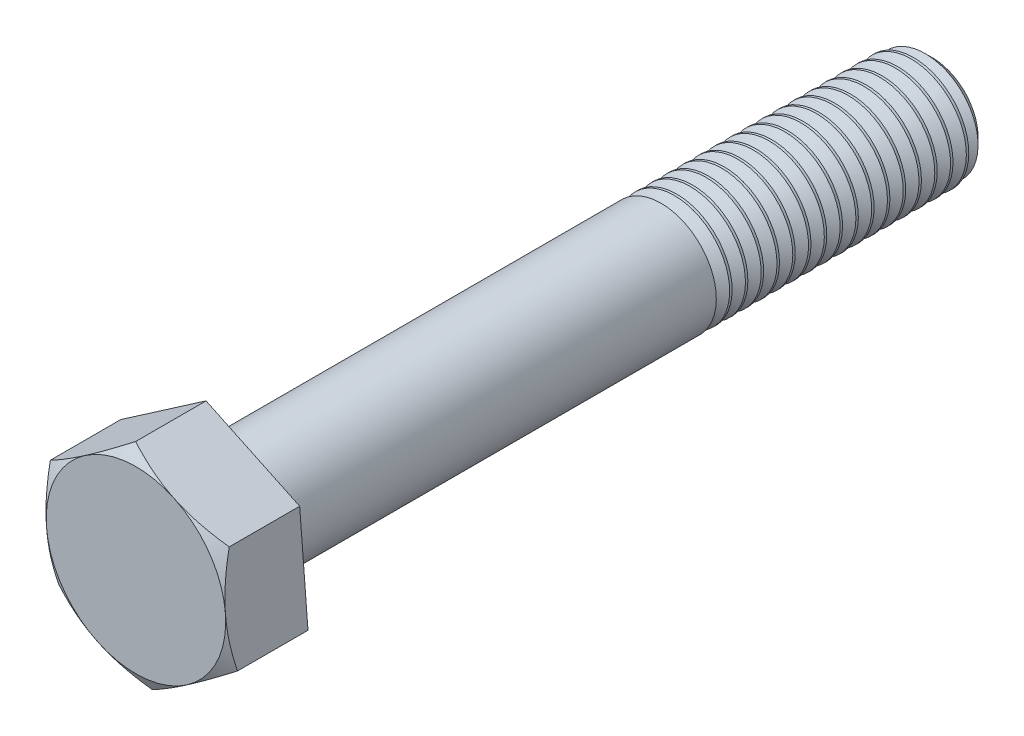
ISO-10303-21;
HEADER;
FILE_DESCRIPTION(('STEP AP214'),'2;1');
FILE_NAME('part.step','',(''),(''),'','','');
FILE_SCHEMA(('AUTOMOTIVE_DESIGN { 1 0 10303 214 1 1 1 1 }'));
ENDSEC;
DATA;
#1=APPLICATION_CONTEXT('core data for automotive mechanical design processes');
#2=APPLICATION_PROTOCOL_DEFINITION('international standard','automotive_design',2000,#1);
#3=PRODUCT_CONTEXT('',#1,'mechanical');
#4=PRODUCT('Part','Part','',(#3));
#5=PRODUCT_RELATED_PRODUCT_CATEGORY('part','',(#4));
#6=PRODUCT_DEFINITION_FORMATION('','',#4);
#7=PRODUCT_DEFINITION_CONTEXT('part definition',#1,'design');
#8=PRODUCT_DEFINITION('design','',#6,#7);
#9=PRODUCT_DEFINITION_SHAPE('','',#8);
#10=(LENGTH_UNIT() NAMED_UNIT(*) SI_UNIT(.MILLI.,.METRE.));
#11=(NAMED_UNIT(*) PLANE_ANGLE_UNIT() SI_UNIT($,.RADIAN.));
#12=(NAMED_UNIT(*) SI_UNIT($,.STERADIAN.) SOLID_ANGLE_UNIT());
#13=UNCERTAINTY_MEASURE_WITH_UNIT(LENGTH_MEASURE(1.E-05),#10,'distance_accuracy_value','');
#14=(GEOMETRIC_REPRESENTATION_CONTEXT(3) GLOBAL_UNCERTAINTY_ASSIGNED_CONTEXT((#13)) GLOBAL_UNIT_ASSIGNED_CONTEXT((#10,
#11,#12)) REPRESENTATION_CONTEXT('',''));
#15=CARTESIAN_POINT('',(0.,0.,0.));
#16=DIRECTION('',(0.,0.,1.));
#17=DIRECTION('',(1.,0.,0.));
#18=AXIS2_PLACEMENT_3D('',#15,#16,#17);
#19=CARTESIAN_POINT('',(719.296983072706,-4.93009120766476,5.));
#20=DIRECTION('',(0.567885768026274,-0.823107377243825,0.));
#21=DIRECTION('',(-0.823107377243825,-0.567885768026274,0.));
#22=AXIS2_PLACEMENT_3D('',#19,#20,#21);
#23=PLANE('',#22);
#24=CARTESIAN_POINT('',(725.475049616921,-0.66766304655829,10.0993767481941));
#25=CARTESIAN_POINT('',(725.339252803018,-0.761353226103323,10.1469955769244));
#26=CARTESIAN_POINT('',(725.202949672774,-0.855392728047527,10.1924532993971));
#27=CARTESIAN_POINT('',(724.929236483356,-1.04423543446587,10.2784513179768));
#28=CARTESIAN_POINT('',(724.791825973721,-1.13903894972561,10.3189894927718));
#29=CARTESIAN_POINT('',(724.37739432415,-1.4249674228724,10.4324289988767));
#30=CARTESIAN_POINT('',(724.098737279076,-1.61722103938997,10.4969521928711));
#31=CARTESIAN_POINT('',(723.681732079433,-1.90492507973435,10.5726134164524));
#32=CARTESIAN_POINT('',(723.544629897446,-1.99951587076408,10.5941671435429));
#33=CARTESIAN_POINT('',(723.269806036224,-2.18912486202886,10.6303096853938));
#34=CARTESIAN_POINT('',(723.132084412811,-2.28414302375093,10.6448991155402));
#35=CARTESIAN_POINT('',(722.856401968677,-2.4743443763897,10.6667412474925));
#36=CARTESIAN_POINT('',(722.71844159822,-2.5695272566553,10.6740022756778));
#37=CARTESIAN_POINT('',(722.442401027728,-2.75997569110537,10.6810396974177));
#38=CARTESIAN_POINT('',(722.304320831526,-2.85524124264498,10.6808163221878));
#39=CARTESIAN_POINT('',(721.926025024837,-3.11623854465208,10.6699165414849));
#40=CARTESIAN_POINT('',(721.685933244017,-3.28188486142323,10.6516181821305));
#41=CARTESIAN_POINT('',(721.20734435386,-3.612077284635,10.5935936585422));
#42=CARTESIAN_POINT('',(720.968848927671,-3.77662222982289,10.5538476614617));
#43=CARTESIAN_POINT('',(720.489296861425,-4.10747917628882,10.4544940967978));
#44=CARTESIAN_POINT('',(720.248300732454,-4.27374942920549,10.3944655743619));
#45=CARTESIAN_POINT('',(719.769902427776,-4.60381036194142,10.2582250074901));
#46=CARTESIAN_POINT('',(719.532494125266,-4.7676052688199,10.1820449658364));
#47=CARTESIAN_POINT('',(719.2967929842,-4.93022235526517,10.0993767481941));
#48=B_SPLINE_CURVE_WITH_KNOTS('',3,(#24,#25,#26,#27,#28,#29,#30,#31,#32,#33,#34,#35,#36,#37,#38,
#39,#40,#41,#42,#43,#44,#45,#46,#47),.UNSPECIFIED.,.F.,.F.,(4,2,2,2,2,2,2,2,2,2,2,4),(0.,
0.515105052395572,1.03043143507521,2.06322554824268,2.5669738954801,3.07067772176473,
3.57380860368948,4.07692394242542,4.95279354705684,5.82947446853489,6.72559912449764,
7.61996451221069),.UNSPECIFIED.);
#49=CARTESIAN_POINT('',(725.474859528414,-0.667794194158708,10.0994434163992));
#50=VERTEX_POINT('',#49);
#51=CARTESIAN_POINT('',(722.38592130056,-2.79894270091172,10.68));
#52=VERTEX_POINT('',#51);
#53=EDGE_CURVE('E32',#50,#52,#48,.T.);
#54=ORIENTED_EDGE('',*,*,#53,.F.);
#55=DIRECTION('',(0.,0.,1.));
#56=VECTOR('',#55,1.);
#57=CARTESIAN_POINT('',(725.474859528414,-0.667794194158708,5.));
#58=LINE('',#57,#56);
#59=CARTESIAN_POINT('',(725.474859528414,-0.667794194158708,5.));
#60=VERTEX_POINT('',#59);
#61=EDGE_CURVE('E131',#60,#50,#58,.T.);
#62=ORIENTED_EDGE('',*,*,#61,.F.);
#63=DIRECTION('',(0.823107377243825,0.567885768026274,0.));
#64=VECTOR('',#63,1.);
#65=CARTESIAN_POINT('',(719.296983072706,-4.93009120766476,5.));
#66=LINE('',#65,#64);
#67=CARTESIAN_POINT('',(719.296983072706,-4.93009120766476,5.));
#68=VERTEX_POINT('',#67);
#69=EDGE_CURVE('E242',#68,#60,#66,.T.);
#70=ORIENTED_EDGE('',*,*,#69,.F.);
#71=DIRECTION('',(0.,0.,1.));
#72=VECTOR('',#71,1.);
#73=CARTESIAN_POINT('',(719.296983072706,-4.93009120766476,5.));
#74=LINE('',#73,#72);
#75=CARTESIAN_POINT('',(719.296983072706,-4.93009120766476,10.0994434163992));
#76=VERTEX_POINT('',#75);
#77=EDGE_CURVE('E118',#68,#76,#74,.T.);
#78=ORIENTED_EDGE('',*,*,#77,.T.);
#79=EDGE_CURVE('E112',#52,#76,#48,.T.);
#80=ORIENTED_EDGE('',*,*,#79,.F.);
#81=EDGE_LOOP('',(#54,#62,#70,#78,#80));
#82=FACE_BOUND('',#81,.T.);
#83=ADVANCED_FACE('F16',(#82),#23,.F.);
#84=CARTESIAN_POINT('',(725.474859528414,-0.667794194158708,5.));
#85=DIRECTION('',(-0.428889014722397,-0.903357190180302,0.));
#86=DIRECTION('',(-0.903357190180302,0.428889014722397,0.));
#87=AXIS2_PLACEMENT_3D('',#84,#85,#86);
#88=PLANE('',#87);
#89=CARTESIAN_POINT('',(732.255263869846,-3.8869426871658,10.0993767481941));
#90=CARTESIAN_POINT('',(732.106227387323,-3.81618428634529,10.1469955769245));
#91=CARTESIAN_POINT('',(731.956635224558,-3.74516206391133,10.1924532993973));
#92=CARTESIAN_POINT('',(731.656236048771,-3.60254084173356,10.278451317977));
#93=CARTESIAN_POINT('',(731.505428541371,-3.53094160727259,10.318989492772));
#94=CARTESIAN_POINT('',(731.050591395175,-3.31499750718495,10.4324289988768));
#95=CARTESIAN_POINT('',(730.744766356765,-3.16980023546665,10.4969521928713));
#96=CARTESIAN_POINT('',(730.287104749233,-2.95251515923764,10.5726134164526));
#97=CARTESIAN_POINT('',(730.136635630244,-2.88107658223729,10.5941671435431));
#98=CARTESIAN_POINT('',(729.835017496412,-2.73787663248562,10.630309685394));
#99=CARTESIAN_POINT('',(729.683868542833,-2.66611528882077,10.6448991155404));
#100=CARTESIAN_POINT('',(729.381308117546,-2.52246796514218,10.6667412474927));
#101=CARTESIAN_POINT('',(729.229897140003,-2.45058221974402,10.674002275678));
#102=CARTESIAN_POINT('',(728.926943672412,-2.30674829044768,10.6810396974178));
#103=CARTESIAN_POINT('',(728.775401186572,-2.23480010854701,10.6808163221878));
#104=CARTESIAN_POINT('',(728.360222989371,-2.03768498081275,10.6699165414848));
#105=CARTESIAN_POINT('',(728.096723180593,-1.91258255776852,10.6516181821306));
#106=CARTESIAN_POINT('',(727.571473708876,-1.66320863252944,10.5935936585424));
#107=CARTESIAN_POINT('',(727.309725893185,-1.53893800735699,10.5538476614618));
#108=CARTESIAN_POINT('',(726.783419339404,-1.28906220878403,10.454494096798));
#109=CARTESIAN_POINT('',(726.518927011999,-1.16348856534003,10.3944655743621));
#110=CARTESIAN_POINT('',(725.993886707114,-0.914213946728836,10.2582250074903));
#111=CARTESIAN_POINT('',(725.733332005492,-0.790509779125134,10.1820449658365));
#112=CARTESIAN_POINT('',(725.474650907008,-0.667695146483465,10.0993767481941));
#113=B_SPLINE_CURVE_WITH_KNOTS('',3,(#89,#90,#91,#92,#93,#94,#95,#96,#97,#98,#99,#100,#101,#102,
#103,#104,#105,#106,#107,#108,#109,#110,#111,#112),.UNSPECIFIED.,.F.,.F.,(4,2,2,2,2,2,2,2,2,2,2,
4),(0.,0.515105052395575,1.0304314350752,2.0632255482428,2.56697389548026,3.07067772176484,
3.5738086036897,4.07692394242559,4.95279354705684,5.82947446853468,6.72559912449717,
7.61996451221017),.UNSPECIFIED.);
#114=CARTESIAN_POINT('',(732.255055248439,-3.88684363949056,10.0994434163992));
#115=VERTEX_POINT('',#114);
#116=CARTESIAN_POINT('',(728.864957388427,-2.27731891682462,10.68));
#117=VERTEX_POINT('',#116);
#118=EDGE_CURVE('E40',#115,#117,#113,.T.);
#119=ORIENTED_EDGE('',*,*,#118,.F.);
#120=DIRECTION('',(0.,0.,1.));
#121=VECTOR('',#120,1.);
#122=CARTESIAN_POINT('',(732.255055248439,-3.88684363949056,5.));
#123=LINE('',#122,#121);
#124=CARTESIAN_POINT('',(732.255055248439,-3.88684363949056,5.));
#125=VERTEX_POINT('',#124);
#126=EDGE_CURVE('E128',#125,#115,#123,.T.);
#127=ORIENTED_EDGE('',*,*,#126,.F.);
#128=DIRECTION('',(0.903357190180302,-0.428889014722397,0.));
#129=VECTOR('',#128,1.);
#130=CARTESIAN_POINT('',(725.474859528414,-0.667794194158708,5.));
#131=LINE('',#130,#129);
#132=EDGE_CURVE('E237',#60,#125,#131,.T.);
#133=ORIENTED_EDGE('',*,*,#132,.F.);
#134=ORIENTED_EDGE('',*,*,#61,.T.);
#135=EDGE_CURVE('E168',#117,#50,#113,.T.);
#136=ORIENTED_EDGE('',*,*,#135,.F.);
#137=EDGE_LOOP('',(#119,#127,#133,#134,#136));
#138=FACE_BOUND('',#137,.T.);
#139=ADVANCED_FACE('F212',(#138),#88,.F.);
#140=CARTESIAN_POINT('',(732.255055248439,-3.88684363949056,5.));
#141=DIRECTION('',(-0.996774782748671,-0.0802498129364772,0.));
#142=DIRECTION('',(0.,0.,1.));
#143=AXIS2_PLACEMENT_3D('',#140,#141,#142);
#144=PLANE('',#143);
#145=CARTESIAN_POINT('',(733.367841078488,-17.7086435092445,7.49164688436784));
#146=CARTESIAN_POINT('',(733.345032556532,-17.4253411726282,7.6296522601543));
#147=CARTESIAN_POINT('',(733.322171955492,-17.1413919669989,7.7663438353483));
#148=CARTESIAN_POINT('',(733.276318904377,-16.5718558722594,8.03636100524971));
#149=CARTESIAN_POINT('',(733.253326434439,-16.2862687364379,8.16968607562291));
#150=CARTESIAN_POINT('',(733.207064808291,-15.7116577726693,8.43289526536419));
#151=CARTESIAN_POINT('',(733.183794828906,-15.4226237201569,8.56275699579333));
#152=CARTESIAN_POINT('',(733.137070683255,-14.8422678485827,8.81720917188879));
#153=CARTESIAN_POINT('',(733.113616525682,-14.5509461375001,8.94179986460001));
#154=CARTESIAN_POINT('',(733.065726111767,-13.9561041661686,9.18823314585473));
#155=CARTESIAN_POINT('',(733.041282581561,-13.652493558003,9.30985742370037));
#156=CARTESIAN_POINT('',(732.992110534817,-13.0417325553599,9.54398134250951));
#157=CARTESIAN_POINT('',(732.967381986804,-12.7345817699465,9.65647996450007));
#158=CARTESIAN_POINT('',(732.917646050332,-12.1168167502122,9.86942463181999));
#159=CARTESIAN_POINT('',(732.892639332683,-11.8062108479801,9.96989476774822));
#160=CARTESIAN_POINT('',(732.842266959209,-11.1805407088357,10.155579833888));
#161=CARTESIAN_POINT('',(732.816901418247,-10.8654778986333,10.240799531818));
#162=CARTESIAN_POINT('',(732.765936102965,-10.2324428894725,10.3914757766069));
#163=CARTESIAN_POINT('',(732.74033837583,-9.91449611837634,10.4570381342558));
#164=CARTESIAN_POINT('',(732.688818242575,-9.27456977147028,10.5646871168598));
#165=CARTESIAN_POINT('',(732.662895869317,-8.95259060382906,10.606776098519));
#166=CARTESIAN_POINT('',(732.624044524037,-8.47002198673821,10.6495112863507));
#167=CARTESIAN_POINT('',(732.611184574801,-8.31028986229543,10.6603506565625));
#168=CARTESIAN_POINT('',(732.585438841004,-7.99050471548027,10.675247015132));
#169=CARTESIAN_POINT('',(732.572553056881,-7.83045169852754,10.6793041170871));
#170=CARTESIAN_POINT('',(732.546779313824,-7.5103186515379,10.6805315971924));
#171=CARTESIAN_POINT('',(732.533891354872,-7.35023862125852,10.6777019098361));
#172=CARTESIAN_POINT('',(732.508136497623,-7.03034015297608,10.6652273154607));
#173=CARTESIAN_POINT('',(732.495269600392,-6.87052172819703,10.6555820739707));
#174=CARTESIAN_POINT('',(732.46443321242,-6.48750608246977,10.6245038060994));
#175=CARTESIAN_POINT('',(732.446483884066,-6.26455929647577,10.5998969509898));
#176=CARTESIAN_POINT('',(732.410717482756,-5.82030845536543,10.5387534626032));
#177=CARTESIAN_POINT('',(732.392900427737,-5.59900462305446,10.50221524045));
#178=CARTESIAN_POINT('',(732.33966907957,-4.93782344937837,10.3766399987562));
#179=CARTESIAN_POINT('',(732.304493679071,-4.50091336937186,10.2716641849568));
#180=CARTESIAN_POINT('',(732.251881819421,-3.84742679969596,10.0894354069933));
#181=CARTESIAN_POINT('',(732.234173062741,-3.62746813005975,10.0236868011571));
#182=CARTESIAN_POINT('',(732.198927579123,-3.18968755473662,9.8853183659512));
#183=CARTESIAN_POINT('',(732.181390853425,-2.97186566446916,9.81269848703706));
#184=CARTESIAN_POINT('',(732.146483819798,-2.53828894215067,9.66175646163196));
#185=CARTESIAN_POINT('',(732.129113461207,-2.32253348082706,9.58343611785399));
#186=CARTESIAN_POINT('',(732.094517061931,-1.8928151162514,9.42201913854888));
#187=CARTESIAN_POINT('',(732.077291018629,-1.67885218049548,9.33892258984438));
#188=CARTESIAN_POINT('',(732.033075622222,-1.12965722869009,9.11970980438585));
#189=CARTESIAN_POINT('',(732.006180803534,-0.79559941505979,8.98063643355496));
#190=CARTESIAN_POINT('',(731.95264834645,-0.130678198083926,8.69498041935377));
#191=CARTESIAN_POINT('',(731.926010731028,0.200184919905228,8.54839711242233));
#192=CARTESIAN_POINT('',(731.87293758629,0.859401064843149,8.24940251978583));
#193=CARTESIAN_POINT('',(731.846502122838,1.18775327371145,8.09698942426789));
#194=CARTESIAN_POINT('',(731.793803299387,1.84232001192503,7.78765130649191));
#195=CARTESIAN_POINT('',(731.767539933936,2.16853460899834,7.63072642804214));
#196=CARTESIAN_POINT('',(731.715116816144,2.81967683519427,7.31307986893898));
#197=CARTESIAN_POINT('',(731.688957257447,3.14460205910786,7.15235323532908));
#198=CARTESIAN_POINT('',(731.636753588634,3.79301853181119,6.8280144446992));
#199=CARTESIAN_POINT('',(731.610709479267,4.11650977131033,6.66440226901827));
#200=CARTESIAN_POINT('',(731.532729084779,5.08509633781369,6.17013815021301));
#201=CARTESIAN_POINT('',(731.480935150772,5.72842353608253,5.83600002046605));
#202=CARTESIAN_POINT('',(731.382643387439,6.94929555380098,5.19424009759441));
#203=CARTESIAN_POINT('',(731.336120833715,7.5271474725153,4.88720356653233));
#204=CARTESIAN_POINT('',(731.243236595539,8.68085316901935,4.26930811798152));
#205=CARTESIAN_POINT('',(731.196874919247,9.25670684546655,3.95844901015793));
#206=CARTESIAN_POINT('',(731.104413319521,10.4051629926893,3.33480224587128));
#207=CARTESIAN_POINT('',(731.058313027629,10.9777700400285,3.022023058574));
#208=CARTESIAN_POINT('',(730.966213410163,12.1217300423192,2.39425602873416));
#209=CARTESIAN_POINT('',(730.920214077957,12.6930830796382,2.07926833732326));
#210=CARTESIAN_POINT('',(730.874250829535,13.2639879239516,1.76347032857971));
#211=B_SPLINE_CURVE_WITH_KNOTS('',3,(#145,#146,#147,#148,#149,#150,#151,#152,#153,#154,#155,
#156,#157,#158,#159,#160,#161,#162,#163,#164,#165,#166,#167,#168,#169,#170,#171,#172,#173,#174,
#175,#176,#177,#178,#179,#180,#181,#182,#183,#184,#185,#186,#187,#188,#189,#190,#191,#192,#193,
#194,#195,#196,#197,#198,#199,#200,#201,#202,#203,#204,#205,#206,#207,#208,#209,#210),
.UNSPECIFIED.,.F.,.F.,(4,2,2,2,2,2,2,2,2,2,2,2,2,2,2,2,2,2,2,2,2,2,2,2,2,2,2,2,2,2,2,2,4),(0.,
0.947868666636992,1.89588406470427,2.84900320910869,3.80207763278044,4.78589774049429,
5.76982755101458,6.75175256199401,7.73337005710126,8.70960474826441,9.68574140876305,
10.1674651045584,10.6491807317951,11.1309009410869,11.6126447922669,12.2873175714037,
12.9620802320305,14.3123184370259,15.0030310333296,15.6937486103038,16.3842486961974,
17.0747362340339,18.1631508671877,19.2516618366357,20.3405135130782,21.4293305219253,
22.5196540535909,23.6099846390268,25.7902468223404,27.7582608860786,29.7263733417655,
31.6886408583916,33.6507753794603),.UNSPECIFIED.);
#212=CARTESIAN_POINT('',(732.857374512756,-11.3681900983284,10.0994434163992));
#213=VERTEX_POINT('',#212);
#214=CARTESIAN_POINT('',(732.556214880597,-7.62751686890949,10.68));
#215=VERTEX_POINT('',#214);
#216=EDGE_CURVE('E166',#213,#215,#211,.T.);
#217=ORIENTED_EDGE('',*,*,#216,.F.);
#218=DIRECTION('',(0.,0.,1.));
#219=VECTOR('',#218,1.);
#220=CARTESIAN_POINT('',(732.857374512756,-11.3681900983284,5.));
#221=LINE('',#220,#219);
#222=CARTESIAN_POINT('',(732.857374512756,-11.3681900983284,5.));
#223=VERTEX_POINT('',#222);
#224=EDGE_CURVE('E120',#223,#213,#221,.T.);
#225=ORIENTED_EDGE('',*,*,#224,.F.);
#226=DIRECTION('',(0.0802498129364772,-0.996774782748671,0.));
#227=VECTOR('',#226,1.);
#228=CARTESIAN_POINT('',(732.255055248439,-3.88684363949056,5.));
#229=LINE('',#228,#227);
#230=EDGE_CURVE('E241',#125,#223,#229,.T.);
#231=ORIENTED_EDGE('',*,*,#230,.F.);
#232=ORIENTED_EDGE('',*,*,#126,.T.);
#233=EDGE_CURVE('E164',#215,#115,#211,.T.);
#234=ORIENTED_EDGE('',*,*,#233,.F.);
#235=EDGE_LOOP('',(#217,#225,#231,#232,#234));
#236=FACE_BOUND('',#235,.T.);
#237=ADVANCED_FACE('F215',(#236),#144,.F.);
#238=CARTESIAN_POINT('',(726.679498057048,-15.6304871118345,5.));
#239=DIRECTION('',(-0.567885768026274,0.823107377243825,0.));
#240=DIRECTION('',(0.823107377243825,0.567885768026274,0.));
#241=AXIS2_PLACEMENT_3D('',#238,#239,#240);
#242=PLANE('',#241);
#243=CARTESIAN_POINT('',(726.679307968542,-15.6306182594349,10.0993767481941));
#244=CARTESIAN_POINT('',(726.815104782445,-15.5369280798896,10.1469955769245));
#245=CARTESIAN_POINT('',(726.951407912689,-15.4428885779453,10.1924532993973));
#246=CARTESIAN_POINT('',(727.225121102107,-15.2540458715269,10.278451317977));
#247=CARTESIAN_POINT('',(727.362531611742,-15.1592423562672,10.318989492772));
#248=CARTESIAN_POINT('',(727.776963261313,-14.8733138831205,10.4324289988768));
#249=CARTESIAN_POINT('',(728.055620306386,-14.6810602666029,10.4969521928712));
#250=CARTESIAN_POINT('',(728.472625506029,-14.3933562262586,10.5726134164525));
#251=CARTESIAN_POINT('',(728.609727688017,-14.2987654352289,10.594167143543));
#252=CARTESIAN_POINT('',(728.884551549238,-14.1091564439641,10.6303096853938));
#253=CARTESIAN_POINT('',(729.022273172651,-14.0141382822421,10.6448991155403));
#254=CARTESIAN_POINT('',(729.297955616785,-13.8239369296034,10.6667412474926));
#255=CARTESIAN_POINT('',(729.435915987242,-13.7287540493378,10.6740022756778));
#256=CARTESIAN_POINT('',(729.711956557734,-13.5383056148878,10.6810396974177));
#257=CARTESIAN_POINT('',(729.850036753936,-13.4430400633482,10.6808163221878));
#258=CARTESIAN_POINT('',(730.228332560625,-13.1820427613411,10.6699165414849));
#259=CARTESIAN_POINT('',(730.468424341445,-13.01639644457,10.6516181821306));
#260=CARTESIAN_POINT('',(730.947013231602,-12.6862040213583,10.5935936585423));
#261=CARTESIAN_POINT('',(731.185508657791,-12.5216590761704,10.5538476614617));
#262=CARTESIAN_POINT('',(731.665060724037,-12.1908021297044,10.4544940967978));
#263=CARTESIAN_POINT('',(731.906056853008,-12.0245318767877,10.394465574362));
#264=CARTESIAN_POINT('',(732.384455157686,-11.6944709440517,10.2582250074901));
#265=CARTESIAN_POINT('',(732.621863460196,-11.5306760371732,10.1820449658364));
#266=CARTESIAN_POINT('',(732.857564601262,-11.368058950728,10.0993767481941));
#267=B_SPLINE_CURVE_WITH_KNOTS('',3,(#243,#244,#245,#246,#247,#248,#249,#250,#251,#252,#253,
#254,#255,#256,#257,#258,#259,#260,#261,#262,#263,#264,#265,#266),.UNSPECIFIED.,.F.,.F.,(4,2,2,
2,2,2,2,2,2,2,2,4),(0.,0.515105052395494,1.03043143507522,2.06322554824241,2.56697389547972,
3.07067772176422,3.57380860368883,4.07692394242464,4.95279354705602,5.82947446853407,
6.72559912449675,7.61996451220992),.UNSPECIFIED.);
#268=CARTESIAN_POINT('',(726.679498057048,-15.6304871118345,10.0994434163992));
#269=VERTEX_POINT('',#268);
#270=CARTESIAN_POINT('',(729.768436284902,-13.4993386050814,10.68));
#271=VERTEX_POINT('',#270);
#272=EDGE_CURVE('E152',#269,#271,#267,.T.);
#273=ORIENTED_EDGE('',*,*,#272,.F.);
#274=DIRECTION('',(0.,0.,1.));
#275=VECTOR('',#274,1.);
#276=CARTESIAN_POINT('',(726.679498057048,-15.6304871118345,5.));
#277=LINE('',#276,#275);
#278=CARTESIAN_POINT('',(726.679498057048,-15.6304871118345,5.));
#279=VERTEX_POINT('',#278);
#280=EDGE_CURVE('E117',#279,#269,#277,.T.);
#281=ORIENTED_EDGE('',*,*,#280,.F.);
#282=DIRECTION('',(-0.823107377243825,-0.567885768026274,0.));
#283=VECTOR('',#282,1.);
#284=CARTESIAN_POINT('',(726.679498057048,-15.6304871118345,5.));
#285=LINE('',#284,#283);
#286=EDGE_CURVE('E250',#223,#279,#285,.T.);
#287=ORIENTED_EDGE('',*,*,#286,.F.);
#288=ORIENTED_EDGE('',*,*,#224,.T.);
#289=EDGE_CURVE('E158',#271,#213,#267,.T.);
#290=ORIENTED_EDGE('',*,*,#289,.F.);
#291=EDGE_LOOP('',(#273,#281,#287,#288,#290));
#292=FACE_BOUND('',#291,.T.);
#293=ADVANCED_FACE('F159',(#292),#242,.F.);
#294=CARTESIAN_POINT('',(719.899302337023,-12.4114376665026,5.));
#295=DIRECTION('',(0.428889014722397,0.903357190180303,0.));
#296=DIRECTION('',(0.903357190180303,-0.428889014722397,0.));
#297=AXIS2_PLACEMENT_3D('',#294,#295,#296);
#298=PLANE('',#297);
#299=CARTESIAN_POINT('',(719.899093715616,-12.4113386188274,10.0993767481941));
#300=CARTESIAN_POINT('',(720.048130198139,-12.4820970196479,10.1469955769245));
#301=CARTESIAN_POINT('',(720.197722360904,-12.5531192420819,10.1924532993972));
#302=CARTESIAN_POINT('',(720.498121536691,-12.6957404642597,10.2784513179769));
#303=CARTESIAN_POINT('',(720.648929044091,-12.7673396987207,10.3189894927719));
#304=CARTESIAN_POINT('',(721.103766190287,-12.9832837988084,10.4324289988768));
#305=CARTESIAN_POINT('',(721.409591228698,-13.1284810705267,10.4969521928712));
#306=CARTESIAN_POINT('',(721.867252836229,-13.3457661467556,10.5726134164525));
#307=CARTESIAN_POINT('',(722.017721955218,-13.417204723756,10.594167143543));
#308=CARTESIAN_POINT('',(722.31934008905,-13.5604046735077,10.6303096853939));
#309=CARTESIAN_POINT('',(722.470489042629,-13.6321660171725,10.6448991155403));
#310=CARTESIAN_POINT('',(722.773049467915,-13.7758133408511,10.6667412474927));
#311=CARTESIAN_POINT('',(722.924460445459,-13.8476990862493,10.6740022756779));
#312=CARTESIAN_POINT('',(723.22741391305,-13.9915330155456,10.6810396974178));
#313=CARTESIAN_POINT('',(723.37895639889,-14.0634811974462,10.6808163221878));
#314=CARTESIAN_POINT('',(723.794134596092,-14.2605963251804,10.6699165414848));
#315=CARTESIAN_POINT('',(724.057634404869,-14.3856987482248,10.6516181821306));
#316=CARTESIAN_POINT('',(724.582883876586,-14.635072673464,10.5935936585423));
#317=CARTESIAN_POINT('',(724.844631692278,-14.7593432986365,10.5538476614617));
#318=CARTESIAN_POINT('',(725.370938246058,-15.0092190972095,10.4544940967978));
#319=CARTESIAN_POINT('',(725.635430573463,-15.1347927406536,10.3944655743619));
#320=CARTESIAN_POINT('',(726.160470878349,-15.3840673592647,10.2582250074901));
#321=CARTESIAN_POINT('',(726.421025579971,-15.5077715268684,10.1820449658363));
#322=CARTESIAN_POINT('',(726.679706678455,-15.6305861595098,10.0993767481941));
#323=B_SPLINE_CURVE_WITH_KNOTS('',3,(#299,#300,#301,#302,#303,#304,#305,#306,#307,#308,#309,
#310,#311,#312,#313,#314,#315,#316,#317,#318,#319,#320,#321,#322),.UNSPECIFIED.,.F.,.F.,(4,2,2,
2,2,2,2,2,2,2,2,4),(0.,0.515105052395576,1.03043143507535,2.06322554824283,2.56697389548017,
3.07067772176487,3.57380860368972,4.07692394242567,4.95279354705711,5.8294744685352,
6.72559912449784,7.61996451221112),.UNSPECIFIED.);
#324=CARTESIAN_POINT('',(719.899302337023,-12.4114376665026,10.0994434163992));
#325=VERTEX_POINT('',#324);
#326=CARTESIAN_POINT('',(723.289400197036,-14.0209623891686,10.68));
#327=VERTEX_POINT('',#326);
#328=EDGE_CURVE('E93',#325,#327,#323,.T.);
#329=ORIENTED_EDGE('',*,*,#328,.F.);
#330=DIRECTION('',(0.,0.,1.));
#331=VECTOR('',#330,1.);
#332=CARTESIAN_POINT('',(719.899302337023,-12.4114376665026,5.));
#333=LINE('',#332,#331);
#334=CARTESIAN_POINT('',(719.899302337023,-12.4114376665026,5.));
#335=VERTEX_POINT('',#334);
#336=EDGE_CURVE('E108',#335,#325,#333,.T.);
#337=ORIENTED_EDGE('',*,*,#336,.F.);
#338=DIRECTION('',(-0.903357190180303,0.428889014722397,0.));
#339=VECTOR('',#338,1.);
#340=CARTESIAN_POINT('',(719.899302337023,-12.4114376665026,5.));
#341=LINE('',#340,#339);
#342=EDGE_CURVE('E252',#279,#335,#341,.T.);
#343=ORIENTED_EDGE('',*,*,#342,.F.);
#344=ORIENTED_EDGE('',*,*,#280,.T.);
#345=EDGE_CURVE('E111',#327,#269,#323,.T.);
#346=ORIENTED_EDGE('',*,*,#345,.F.);
#347=EDGE_LOOP('',(#329,#337,#343,#344,#346));
#348=FACE_BOUND('',#347,.T.);
#349=ADVANCED_FACE('F106',(#348),#298,.F.);
#350=CARTESIAN_POINT('',(719.296983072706,-4.93009120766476,5.));
#351=DIRECTION('',(0.996774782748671,0.080249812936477,0.));
#352=DIRECTION('',(0.080249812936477,-0.996774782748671,0.));
#353=AXIS2_PLACEMENT_3D('',#350,#351,#352);
#354=PLANE('',#353);
#355=CARTESIAN_POINT('',(720.4097689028,-18.7518910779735,7.49164688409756));
#356=CARTESIAN_POINT('',(720.386960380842,-18.4685887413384,7.62965225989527));
#357=CARTESIAN_POINT('',(720.3640997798,-18.1846395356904,7.76634383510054));
#358=CARTESIAN_POINT('',(720.318246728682,-17.6151034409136,8.03636100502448));
#359=CARTESIAN_POINT('',(720.295254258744,-17.3295163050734,8.16968607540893));
#360=CARTESIAN_POINT('',(720.248992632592,-16.754905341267,8.4328952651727));
#361=CARTESIAN_POINT('',(720.225722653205,-16.4658712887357,8.56275699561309));
#362=CARTESIAN_POINT('',(720.178998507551,-15.8855154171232,8.81720917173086));
#363=CARTESIAN_POINT('',(720.155544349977,-15.5941937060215,8.94179986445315));
#364=CARTESIAN_POINT('',(720.107653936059,-14.9993517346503,9.18823314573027));
#365=CARTESIAN_POINT('',(720.083210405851,-14.6957411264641,9.30985742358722));
#366=CARTESIAN_POINT('',(720.034038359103,-14.0849801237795,9.54398134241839));
#367=CARTESIAN_POINT('',(720.009309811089,-13.7778293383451,9.65647996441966));
#368=CARTESIAN_POINT('',(719.959573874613,-13.1600643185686,9.86942463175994));
#369=CARTESIAN_POINT('',(719.934567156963,-12.8494584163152,9.96989476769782));
#370=CARTESIAN_POINT('',(719.884194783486,-12.2237882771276,10.1555798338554));
#371=CARTESIAN_POINT('',(719.858829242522,-11.9087254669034,10.2407995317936));
#372=CARTESIAN_POINT('',(719.807863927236,-11.2756904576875,10.3914757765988));
#373=CARTESIAN_POINT('',(719.782266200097,-10.9577436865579,10.4570381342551));
#374=CARTESIAN_POINT('',(719.730746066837,-10.3178173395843,10.5646871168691));
#375=CARTESIAN_POINT('',(719.704823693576,-9.99583817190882,10.6067760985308));
#376=CARTESIAN_POINT('',(719.665972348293,-9.5132695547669,10.6495112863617));
#377=CARTESIAN_POINT('',(719.653112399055,-9.35353743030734,10.6603506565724));
#378=CARTESIAN_POINT('',(719.627366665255,-9.03375228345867,10.6752470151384));
#379=CARTESIAN_POINT('',(719.61448088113,-8.8736992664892,10.679304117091));
#380=CARTESIAN_POINT('',(719.588707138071,-8.55356621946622,10.6805315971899));
#381=CARTESIAN_POINT('',(719.575819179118,-8.39348618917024,10.6777019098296));
#382=CARTESIAN_POINT('',(719.550064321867,-8.07358772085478,10.6652273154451));
#383=CARTESIAN_POINT('',(719.537197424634,-7.91376929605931,10.6555820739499));
#384=CARTESIAN_POINT('',(719.50636103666,-7.53075365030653,10.6245038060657));
#385=CARTESIAN_POINT('',(719.488411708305,-7.30780686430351,10.5998969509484));
#386=CARTESIAN_POINT('',(719.452645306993,-6.86355602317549,10.5387534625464));
#387=CARTESIAN_POINT('',(719.434828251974,-6.64225219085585,10.5022152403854));
#388=CARTESIAN_POINT('',(719.381596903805,-5.98107101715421,10.3766399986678));
#389=CARTESIAN_POINT('',(719.346421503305,-5.54416093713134,10.2716641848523));
#390=CARTESIAN_POINT('',(719.293809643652,-4.89067436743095,10.0894354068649));
#391=CARTESIAN_POINT('',(719.276100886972,-4.67071569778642,10.0236868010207));
#392=CARTESIAN_POINT('',(719.240855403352,-4.23293512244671,9.88531836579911));
#393=CARTESIAN_POINT('',(719.223318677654,-4.015113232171,9.81269848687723));
#394=CARTESIAN_POINT('',(719.188411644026,-3.5815365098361,9.66175646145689));
#395=CARTESIAN_POINT('',(719.171041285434,-3.36578104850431,9.58343611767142));
#396=CARTESIAN_POINT('',(719.136444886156,-2.93606268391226,9.42201913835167));
#397=CARTESIAN_POINT('',(719.119218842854,-2.72209974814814,9.33892258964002));
#398=CARTESIAN_POINT('',(719.075003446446,-2.17290479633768,9.11970980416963));
#399=CARTESIAN_POINT('',(719.048108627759,-1.83884698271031,8.98063643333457));
#400=CARTESIAN_POINT('',(718.994576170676,-1.17392576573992,8.6949804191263));
#401=CARTESIAN_POINT('',(718.967938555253,-0.8430626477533,8.54839711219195));
#402=CARTESIAN_POINT('',(718.914865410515,-0.183846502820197,8.24940251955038));
#403=CARTESIAN_POINT('',(718.888429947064,0.144505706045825,8.0969894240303));
#404=CARTESIAN_POINT('',(718.835731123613,0.799072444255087,7.78765130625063));
#405=CARTESIAN_POINT('',(718.809467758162,1.12528704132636,7.63072642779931));
#406=CARTESIAN_POINT('',(718.757044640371,1.7764292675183,7.31307986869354));
#407=CARTESIAN_POINT('',(718.730885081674,2.10135449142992,7.15235323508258));
#408=CARTESIAN_POINT('',(718.678681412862,2.74977096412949,6.82801444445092));
#409=CARTESIAN_POINT('',(718.652637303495,3.07326220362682,6.66440226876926));
#410=CARTESIAN_POINT('',(718.574656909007,4.04184877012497,6.17013814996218));
#411=CARTESIAN_POINT('',(718.522862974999,4.68517596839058,5.83600002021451));
#412=CARTESIAN_POINT('',(718.424571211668,5.90604798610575,5.19424009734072));
#413=CARTESIAN_POINT('',(718.378048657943,6.48389990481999,4.88720356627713));
#414=CARTESIAN_POINT('',(718.285164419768,7.637605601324,4.26930811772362));
#415=CARTESIAN_POINT('',(718.238802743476,8.21345927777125,3.95844900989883));
#416=CARTESIAN_POINT('',(718.146341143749,9.36191542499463,3.33480224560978));
#417=CARTESIAN_POINT('',(718.100240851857,9.93452247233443,3.02202305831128));
#418=CARTESIAN_POINT('',(718.008141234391,11.0784824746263,2.39425602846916));
#419=CARTESIAN_POINT('',(717.962141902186,11.649835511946,2.07926833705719));
#420=CARTESIAN_POINT('',(717.916178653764,12.2207403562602,1.76347032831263));
#421=B_SPLINE_CURVE_WITH_KNOTS('',3,(#355,#356,#357,#358,#359,#360,#361,#362,#363,#364,#365,
#366,#367,#368,#369,#370,#371,#372,#373,#374,#375,#376,#377,#378,#379,#380,#381,#382,#383,#384,
#385,#386,#387,#388,#389,#390,#391,#392,#393,#394,#395,#396,#397,#398,#399,#400,#401,#402,#403,
#404,#405,#406,#407,#408,#409,#410,#411,#412,#413,#414,#415,#416,#417,#418,#419,#420),
.UNSPECIFIED.,.F.,.F.,(4,2,2,2,2,2,2,2,2,2,2,2,2,2,2,2,2,2,2,2,2,2,2,2,2,2,2,2,2,2,2,2,4),(0.,
0.947868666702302,1.89588406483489,2.84900320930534,3.80207763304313,4.7858977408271,
5.76982755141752,6.75175256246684,7.7333700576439,8.70960474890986,9.68574140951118,
10.1674651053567,10.6491807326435,11.1309009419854,11.6126447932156,12.2873175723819,
12.9620802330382,14.3123184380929,15.0030310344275,15.6937486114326,16.384248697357,
17.0747362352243,18.1631508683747,19.2516618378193,20.3405135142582,21.4293305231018,
22.5196540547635,23.6099846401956,25.7902468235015,27.7582608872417,29.7263733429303,
31.6886408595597,33.6507753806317),.UNSPECIFIED.);
#422=CARTESIAN_POINT('',(719.598142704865,-8.67076443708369,10.68));
#423=VERTEX_POINT('',#422);
#424=EDGE_CURVE('E100',#76,#423,#421,.F.);
#425=ORIENTED_EDGE('',*,*,#424,.F.);
#426=ORIENTED_EDGE('',*,*,#77,.F.);
#427=DIRECTION('',(-0.080249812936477,0.996774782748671,0.));
#428=VECTOR('',#427,1.);
#429=CARTESIAN_POINT('',(719.296983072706,-4.93009120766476,5.));
#430=LINE('',#429,#428);
#431=EDGE_CURVE('E116',#335,#68,#430,.T.);
#432=ORIENTED_EDGE('',*,*,#431,.F.);
#433=ORIENTED_EDGE('',*,*,#336,.T.);
#434=EDGE_CURVE('E90',#423,#325,#421,.F.);
#435=ORIENTED_EDGE('',*,*,#434,.F.);
#436=EDGE_LOOP('',(#425,#426,#432,#433,#435));
#437=FACE_BOUND('',#436,.T.);
#438=ADVANCED_FACE('F114',(#437),#354,.F.);
#439=CARTESIAN_POINT('',(725.474859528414,-0.667794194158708,5.));
#440=DIRECTION('',(0.,0.,-1.));
#441=DIRECTION('',(-0.996774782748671,-0.0802498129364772,0.));
#442=AXIS2_PLACEMENT_3D('',#439,#440,#441);
#443=PLANE('',#442);
#444=CARTESIAN_POINT('',(726.077178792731,-8.14914065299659,5.));
#445=DIRECTION('',(0.,0.,-1.));
#446=DIRECTION('',(-0.996774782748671,-0.0802498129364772,0.));
#447=AXIS2_PLACEMENT_3D('',#444,#445,#446);
#448=CIRCLE('',#447,4.4);
#449=CARTESIAN_POINT('',(721.691369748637,-8.50223982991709,5.));
#450=VERTEX_POINT('',#449);
#451=EDGE_CURVE('E25',#450,#450,#448,.F.);
#452=ORIENTED_EDGE('',*,*,#451,.T.);
#453=EDGE_LOOP('',(#452));
#454=FACE_BOUND('',#453,.T.);
#455=ORIENTED_EDGE('',*,*,#69,.T.);
#456=ORIENTED_EDGE('',*,*,#132,.T.);
#457=ORIENTED_EDGE('',*,*,#230,.T.);
#458=ORIENTED_EDGE('',*,*,#286,.T.);
#459=ORIENTED_EDGE('',*,*,#342,.T.);
#460=ORIENTED_EDGE('',*,*,#431,.T.);
#461=EDGE_LOOP('',(#455,#456,#457,#458,#459,#460));
#462=FACE_BOUND('',#461,.T.);
#463=ADVANCED_FACE('F244',(#454,#462),#443,.T.);
#464=CARTESIAN_POINT('',(726.077178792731,-8.14914065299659,10.68));
#465=DIRECTION('',(0.,0.,1.));
#466=DIRECTION('',(0.996774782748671,0.0802498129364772,0.));
#467=AXIS2_PLACEMENT_3D('',#464,#465,#466);
#468=CYLINDRICAL_SURFACE('',#467,4.);
#469=CARTESIAN_POINT('',(726.077178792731,-8.14914065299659,-27.3530133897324));
#470=DIRECTION('',(0.,0.,1.));
#471=DIRECTION('',(0.0802498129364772,-0.996774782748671,0.));
#472=AXIS2_PLACEMENT_3D('',#469,#470,#471);
#473=CIRCLE('',#472,4.);
#474=CARTESIAN_POINT('',(726.398178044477,-12.1362397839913,-27.3530133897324));
#475=VERTEX_POINT('',#474);
#476=EDGE_CURVE('E255',#475,#475,#473,.T.);
#477=ORIENTED_EDGE('',*,*,#476,.T.);
#478=EDGE_LOOP('',(#477));
#479=FACE_BOUND('',#478,.T.);
#480=CARTESIAN_POINT('',(726.077178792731,-8.14914065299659,4.6));
#481=DIRECTION('',(0.,0.,-1.));
#482=DIRECTION('',(-0.996774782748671,-0.0802498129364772,0.));
#483=AXIS2_PLACEMENT_3D('',#480,#481,#482);
#484=CIRCLE('',#483,4.);
#485=CARTESIAN_POINT('',(722.090079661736,-8.4701399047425,4.6));
#486=VERTEX_POINT('',#485);
#487=EDGE_CURVE('E11',#486,#486,#484,.T.);
#488=ORIENTED_EDGE('',*,*,#487,.T.);
#489=EDGE_LOOP('',(#488));
#490=FACE_BOUND('',#489,.T.);
#491=ADVANCED_FACE('F585',(#479,#490),#468,.T.);
#492=CARTESIAN_POINT('',(726.077178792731,-8.14914065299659,10.68));
#493=DIRECTION('',(0.,0.,-1.));
#494=DIRECTION('',(-0.996774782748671,-0.0802498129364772,0.));
#495=AXIS2_PLACEMENT_3D('',#492,#493,#494);
#496=CONICAL_SURFACE('',#495,6.5,1.0471975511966);
#497=ORIENTED_EDGE('',*,*,#328,.T.);
#498=CARTESIAN_POINT('',(726.077178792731,-8.14914065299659,10.68));
#499=DIRECTION('',(0.,0.,-1.));
#500=DIRECTION('',(-0.996774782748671,-0.0802498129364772,0.));
#501=AXIS2_PLACEMENT_3D('',#498,#499,#500);
#502=CIRCLE('',#501,6.5);
#503=EDGE_CURVE('E95',#327,#423,#502,.T.);
#504=ORIENTED_EDGE('',*,*,#503,.T.);
#505=ORIENTED_EDGE('',*,*,#434,.T.);
#506=EDGE_LOOP('',(#497,#504,#505));
#507=FACE_BOUND('',#506,.T.);
#508=ADVANCED_FACE('F92',(#507),#496,.T.);
#509=ORIENTED_EDGE('',*,*,#272,.T.);
#510=EDGE_CURVE('E135',#271,#327,#502,.T.);
#511=ORIENTED_EDGE('',*,*,#510,.T.);
#512=ORIENTED_EDGE('',*,*,#345,.T.);
#513=EDGE_LOOP('',(#509,#511,#512));
#514=FACE_BOUND('',#513,.T.);
#515=ADVANCED_FACE('F150',(#514),#496,.T.);
#516=ORIENTED_EDGE('',*,*,#216,.T.);
#517=EDGE_CURVE('E143',#215,#271,#502,.T.);
#518=ORIENTED_EDGE('',*,*,#517,.T.);
#519=ORIENTED_EDGE('',*,*,#289,.T.);
#520=EDGE_LOOP('',(#516,#518,#519));
#521=FACE_BOUND('',#520,.T.);
#522=ADVANCED_FACE('F189',(#521),#496,.T.);
#523=ORIENTED_EDGE('',*,*,#233,.T.);
#524=ORIENTED_EDGE('',*,*,#118,.T.);
#525=CARTESIAN_POINT('',(726.077178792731,-8.14914065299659,10.68));
#526=DIRECTION('',(0.,0.,1.));
#527=DIRECTION('',(0.996774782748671,0.0802498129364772,0.));
#528=AXIS2_PLACEMENT_3D('',#525,#526,#527);
#529=CIRCLE('',#528,6.5);
#530=EDGE_CURVE('E101',#215,#117,#529,.T.);
#531=ORIENTED_EDGE('',*,*,#530,.F.);
#532=EDGE_LOOP('',(#523,#524,#531));
#533=FACE_BOUND('',#532,.T.);
#534=ADVANCED_FACE('F194',(#533),#496,.T.);
#535=ORIENTED_EDGE('',*,*,#135,.T.);
#536=ORIENTED_EDGE('',*,*,#53,.T.);
#537=EDGE_CURVE('E140',#52,#117,#502,.T.);
#538=ORIENTED_EDGE('',*,*,#537,.T.);
#539=EDGE_LOOP('',(#535,#536,#538));
#540=FACE_BOUND('',#539,.T.);
#541=ADVANCED_FACE('F866',(#540),#496,.T.);
#542=ORIENTED_EDGE('',*,*,#79,.T.);
#543=ORIENTED_EDGE('',*,*,#424,.T.);
#544=EDGE_CURVE('E136',#423,#52,#502,.T.);
#545=ORIENTED_EDGE('',*,*,#544,.T.);
#546=EDGE_LOOP('',(#542,#543,#545));
#547=FACE_BOUND('',#546,.T.);
#548=ADVANCED_FACE('F861',(#547),#496,.T.);
#549=CARTESIAN_POINT('',(725.474859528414,-0.667794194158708,10.68));
#550=DIRECTION('',(0.,0.,-1.));
#551=DIRECTION('',(-0.996774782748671,-0.0802498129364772,0.));
#552=AXIS2_PLACEMENT_3D('',#549,#550,#551);
#553=PLANE('',#552);
#554=ORIENTED_EDGE('',*,*,#544,.F.);
#555=ORIENTED_EDGE('',*,*,#503,.F.);
#556=ORIENTED_EDGE('',*,*,#510,.F.);
#557=ORIENTED_EDGE('',*,*,#517,.F.);
#558=ORIENTED_EDGE('',*,*,#530,.T.);
#559=ORIENTED_EDGE('',*,*,#537,.F.);
#560=EDGE_LOOP('',(#554,#555,#556,#557,#558,#559));
#561=FACE_BOUND('',#560,.T.);
#562=ADVANCED_FACE('F155',(#561),#553,.F.);
#563=CARTESIAN_POINT('',(726.077178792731,-8.14914065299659,4.6));
#564=DIRECTION('',(0.,0.,-1.));
#565=DIRECTION('',(-0.996774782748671,-0.0802498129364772,0.));
#566=AXIS2_PLACEMENT_3D('',#563,#564,#565);
#567=TOROIDAL_SURFACE('',#566,4.4,0.4);
#568=ORIENTED_EDGE('',*,*,#487,.F.);
#569=EDGE_LOOP('',(#568));
#570=FACE_BOUND('',#569,.T.);
#571=ORIENTED_EDGE('',*,*,#451,.F.);
#572=EDGE_LOOP('',(#571));
#573=FACE_BOUND('',#572,.T.);
#574=ADVANCED_FACE('F195',(#570,#573),#567,.F.);
#575=CARTESIAN_POINT('',(726.077178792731,-8.14914065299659,-28.32));
#576=DIRECTION('',(0.,0.,-1.));
#577=DIRECTION('',(-0.0802498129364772,0.996774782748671,0.));
#578=AXIS2_PLACEMENT_3D('',#575,#576,#577);
#579=CONICAL_SURFACE('',#578,4.,0.959931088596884);
#580=CARTESIAN_POINT('',(726.077178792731,-8.14914065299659,-27.8365066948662));
#581=DIRECTION('',(0.,0.,1.));
#582=DIRECTION('',(0.0802498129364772,-0.996774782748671,0.));
#583=AXIS2_PLACEMENT_3D('',#580,#581,#582);
#584=CIRCLE('',#583,3.3095);
#585=CARTESIAN_POINT('',(726.342765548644,-11.4479667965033,-27.8365066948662));
#586=VERTEX_POINT('',#585);
#587=EDGE_CURVE('E260',#586,#586,#584,.T.);
#588=ORIENTED_EDGE('',*,*,#587,.F.);
#589=EDGE_LOOP('',(#588));
#590=FACE_BOUND('',#589,.T.);
#591=CARTESIAN_POINT('',(726.077178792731,-8.14914065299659,-28.32));
#592=DIRECTION('',(0.,0.,1.));
#593=DIRECTION('',(0.0802498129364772,-0.996774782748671,0.));
#594=AXIS2_PLACEMENT_3D('',#591,#592,#593);
#595=CIRCLE('',#594,4.);
#596=CARTESIAN_POINT('',(726.398178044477,-12.1362397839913,-28.32));
#597=VERTEX_POINT('',#596);
#598=EDGE_CURVE('E253',#597,#597,#595,.T.);
#599=ORIENTED_EDGE('',*,*,#598,.T.);
#600=EDGE_LOOP('',(#599));
#601=FACE_BOUND('',#600,.T.);
#602=ADVANCED_FACE('F569',(#590,#601),#579,.T.);
#603=CARTESIAN_POINT('',(726.077178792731,-8.14914065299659,-27.8365066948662));
#604=DIRECTION('',(0.,0.,1.));
#605=DIRECTION('',(0.0802498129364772,-0.996774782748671,0.));
#606=AXIS2_PLACEMENT_3D('',#603,#604,#605);
#607=CONICAL_SURFACE('',#606,3.3095,0.959931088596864);
#608=ORIENTED_EDGE('',*,*,#476,.F.);
#609=EDGE_LOOP('',(#608));
#610=FACE_BOUND('',#609,.T.);
#611=ORIENTED_EDGE('',*,*,#587,.T.);
#612=EDGE_LOOP('',(#611));
#613=FACE_BOUND('',#612,.T.);
#614=ADVANCED_FACE('F567',(#610,#613),#607,.T.);
#615=CARTESIAN_POINT('',(726.077178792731,-8.14914065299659,-28.4958705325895));
#616=DIRECTION('',(0.,0.,1.));
#617=DIRECTION('',(0.0802498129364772,-0.996774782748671,0.));
#618=AXIS2_PLACEMENT_3D('',#615,#616,#617);
#619=CIRCLE('',#618,4.);
#620=CARTESIAN_POINT('',(726.398178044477,-12.1362397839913,-28.4958705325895));
#621=VERTEX_POINT('',#620);
#622=EDGE_CURVE('E266',#621,#621,#619,.T.);
#623=ORIENTED_EDGE('',*,*,#622,.T.);
#624=EDGE_LOOP('',(#623));
#625=FACE_BOUND('',#624,.T.);
#626=ORIENTED_EDGE('',*,*,#598,.F.);
#627=EDGE_LOOP('',(#626));
#628=FACE_BOUND('',#627,.T.);
#629=ADVANCED_FACE('F565',(#625,#628),#468,.T.);
#630=CARTESIAN_POINT('',(726.077178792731,-8.14914065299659,-29.4628571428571));
#631=DIRECTION('',(0.,0.,-1.));
#632=DIRECTION('',(-0.0802498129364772,0.996774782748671,0.));
#633=AXIS2_PLACEMENT_3D('',#630,#631,#632);
#634=CONICAL_SURFACE('',#633,4.,0.959931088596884);
#635=CARTESIAN_POINT('',(726.077178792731,-8.14914065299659,-28.9793638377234));
#636=DIRECTION('',(0.,0.,1.));
#637=DIRECTION('',(0.0802498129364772,-0.996774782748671,0.));
#638=AXIS2_PLACEMENT_3D('',#635,#636,#637);
#639=CIRCLE('',#638,3.3095);
#640=CARTESIAN_POINT('',(726.342765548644,-11.4479667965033,-28.9793638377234));
#641=VERTEX_POINT('',#640);
#642=EDGE_CURVE('E269',#641,#641,#639,.T.);
#643=ORIENTED_EDGE('',*,*,#642,.F.);
#644=EDGE_LOOP('',(#643));
#645=FACE_BOUND('',#644,.T.);
#646=CARTESIAN_POINT('',(726.077178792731,-8.14914065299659,-29.4628571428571));
#647=DIRECTION('',(0.,0.,1.));
#648=DIRECTION('',(0.0802498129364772,-0.996774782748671,0.));
#649=AXIS2_PLACEMENT_3D('',#646,#647,#648);
#650=CIRCLE('',#649,4.);
#651=CARTESIAN_POINT('',(726.398178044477,-12.1362397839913,-29.4628571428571));
#652=VERTEX_POINT('',#651);
#653=EDGE_CURVE('E263',#652,#652,#650,.T.);
#654=ORIENTED_EDGE('',*,*,#653,.T.);
#655=EDGE_LOOP('',(#654));
#656=FACE_BOUND('',#655,.T.);
#657=ADVANCED_FACE('F561',(#645,#656),#634,.T.);
#658=CARTESIAN_POINT('',(726.077178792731,-8.14914065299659,-28.9793638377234));
#659=DIRECTION('',(0.,0.,1.));
#660=DIRECTION('',(0.0802498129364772,-0.996774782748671,0.));
#661=AXIS2_PLACEMENT_3D('',#658,#659,#660);
#662=CONICAL_SURFACE('',#661,3.3095,0.959931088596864);
#663=ORIENTED_EDGE('',*,*,#622,.F.);
#664=EDGE_LOOP('',(#663));
#665=FACE_BOUND('',#664,.T.);
#666=ORIENTED_EDGE('',*,*,#642,.T.);
#667=EDGE_LOOP('',(#666));
#668=FACE_BOUND('',#667,.T.);
#669=ADVANCED_FACE('F558',(#665,#668),#662,.T.);
#670=CARTESIAN_POINT('',(726.077178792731,-8.14914065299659,-29.6387276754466));
#671=DIRECTION('',(0.,0.,1.));
#672=DIRECTION('',(0.0802498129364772,-0.996774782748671,0.));
#673=AXIS2_PLACEMENT_3D('',#670,#671,#672);
#674=CIRCLE('',#673,4.);
#675=CARTESIAN_POINT('',(726.398178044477,-12.1362397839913,-29.6387276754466));
#676=VERTEX_POINT('',#675);
#677=EDGE_CURVE('E275',#676,#676,#674,.T.);
#678=ORIENTED_EDGE('',*,*,#677,.T.);
#679=EDGE_LOOP('',(#678));
#680=FACE_BOUND('',#679,.T.);
#681=ORIENTED_EDGE('',*,*,#653,.F.);
#682=EDGE_LOOP('',(#681));
#683=FACE_BOUND('',#682,.T.);
#684=ADVANCED_FACE('F556',(#680,#683),#468,.T.);
#685=CARTESIAN_POINT('',(726.077178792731,-8.14914065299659,-30.6057142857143));
#686=DIRECTION('',(0.,0.,-1.));
#687=DIRECTION('',(-0.0802498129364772,0.996774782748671,0.));
#688=AXIS2_PLACEMENT_3D('',#685,#686,#687);
#689=CONICAL_SURFACE('',#688,4.,0.959931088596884);
#690=CARTESIAN_POINT('',(726.077178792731,-8.14914065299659,-30.1222209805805));
#691=DIRECTION('',(0.,0.,1.));
#692=DIRECTION('',(0.0802498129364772,-0.996774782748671,0.));
#693=AXIS2_PLACEMENT_3D('',#690,#691,#692);
#694=CIRCLE('',#693,3.3095);
#695=CARTESIAN_POINT('',(726.342765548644,-11.4479667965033,-30.1222209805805));
#696=VERTEX_POINT('',#695);
#697=EDGE_CURVE('E278',#696,#696,#694,.T.);
#698=ORIENTED_EDGE('',*,*,#697,.F.);
#699=EDGE_LOOP('',(#698));
#700=FACE_BOUND('',#699,.T.);
#701=CARTESIAN_POINT('',(726.077178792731,-8.14914065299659,-30.6057142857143));
#702=DIRECTION('',(0.,0.,1.));
#703=DIRECTION('',(0.0802498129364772,-0.996774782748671,0.));
#704=AXIS2_PLACEMENT_3D('',#701,#702,#703);
#705=CIRCLE('',#704,4.);
#706=CARTESIAN_POINT('',(726.398178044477,-12.1362397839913,-30.6057142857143));
#707=VERTEX_POINT('',#706);
#708=EDGE_CURVE('E272',#707,#707,#705,.T.);
#709=ORIENTED_EDGE('',*,*,#708,.T.);
#710=EDGE_LOOP('',(#709));
#711=FACE_BOUND('',#710,.T.);
#712=ADVANCED_FACE('F552',(#700,#711),#689,.T.);
#713=CARTESIAN_POINT('',(726.077178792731,-8.14914065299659,-30.1222209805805));
#714=DIRECTION('',(0.,0.,1.));
#715=DIRECTION('',(0.0802498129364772,-0.996774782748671,0.));
#716=AXIS2_PLACEMENT_3D('',#713,#714,#715);
#717=CONICAL_SURFACE('',#716,3.3095,0.959931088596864);
#718=ORIENTED_EDGE('',*,*,#677,.F.);
#719=EDGE_LOOP('',(#718));
#720=FACE_BOUND('',#719,.T.);
#721=ORIENTED_EDGE('',*,*,#697,.T.);
#722=EDGE_LOOP('',(#721));
#723=FACE_BOUND('',#722,.T.);
#724=ADVANCED_FACE('F549',(#720,#723),#717,.T.);
#725=CARTESIAN_POINT('',(726.077178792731,-8.14914065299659,-30.7815848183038));
#726=DIRECTION('',(0.,0.,1.));
#727=DIRECTION('',(0.0802498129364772,-0.996774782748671,0.));
#728=AXIS2_PLACEMENT_3D('',#725,#726,#727);
#729=CIRCLE('',#728,4.);
#730=CARTESIAN_POINT('',(726.398178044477,-12.1362397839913,-30.7815848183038));
#731=VERTEX_POINT('',#730);
#732=EDGE_CURVE('E284',#731,#731,#729,.T.);
#733=ORIENTED_EDGE('',*,*,#732,.T.);
#734=EDGE_LOOP('',(#733));
#735=FACE_BOUND('',#734,.T.);
#736=ORIENTED_EDGE('',*,*,#708,.F.);
#737=EDGE_LOOP('',(#736));
#738=FACE_BOUND('',#737,.T.);
#739=ADVANCED_FACE('F547',(#735,#738),#468,.T.);
#740=CARTESIAN_POINT('',(726.077178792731,-8.14914065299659,-31.7485714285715));
#741=DIRECTION('',(0.,0.,-1.));
#742=DIRECTION('',(-0.0802498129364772,0.996774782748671,0.));
#743=AXIS2_PLACEMENT_3D('',#740,#741,#742);
#744=CONICAL_SURFACE('',#743,4.,0.959931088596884);
#745=CARTESIAN_POINT('',(726.077178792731,-8.14914065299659,-31.2650781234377));
#746=DIRECTION('',(0.,0.,1.));
#747=DIRECTION('',(0.0802498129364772,-0.996774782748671,0.));
#748=AXIS2_PLACEMENT_3D('',#745,#746,#747);
#749=CIRCLE('',#748,3.3095);
#750=CARTESIAN_POINT('',(726.342765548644,-11.4479667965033,-31.2650781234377));
#751=VERTEX_POINT('',#750);
#752=EDGE_CURVE('E287',#751,#751,#749,.T.);
#753=ORIENTED_EDGE('',*,*,#752,.F.);
#754=EDGE_LOOP('',(#753));
#755=FACE_BOUND('',#754,.T.);
#756=CARTESIAN_POINT('',(726.077178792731,-8.14914065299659,-31.7485714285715));
#757=DIRECTION('',(0.,0.,1.));
#758=DIRECTION('',(0.0802498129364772,-0.996774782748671,0.));
#759=AXIS2_PLACEMENT_3D('',#756,#757,#758);
#760=CIRCLE('',#759,4.);
#761=CARTESIAN_POINT('',(726.398178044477,-12.1362397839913,-31.7485714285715));
#762=VERTEX_POINT('',#761);
#763=EDGE_CURVE('E281',#762,#762,#760,.T.);
#764=ORIENTED_EDGE('',*,*,#763,.T.);
#765=EDGE_LOOP('',(#764));
#766=FACE_BOUND('',#765,.T.);
#767=ADVANCED_FACE('F543',(#755,#766),#744,.T.);
#768=CARTESIAN_POINT('',(726.077178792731,-8.14914065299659,-31.2650781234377));
#769=DIRECTION('',(0.,0.,1.));
#770=DIRECTION('',(0.0802498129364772,-0.996774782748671,0.));
#771=AXIS2_PLACEMENT_3D('',#768,#769,#770);
#772=CONICAL_SURFACE('',#771,3.3095,0.959931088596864);
#773=ORIENTED_EDGE('',*,*,#732,.F.);
#774=EDGE_LOOP('',(#773));
#775=FACE_BOUND('',#774,.T.);
#776=ORIENTED_EDGE('',*,*,#752,.T.);
#777=EDGE_LOOP('',(#776));
#778=FACE_BOUND('',#777,.T.);
#779=ADVANCED_FACE('F540',(#775,#778),#772,.T.);
#780=CARTESIAN_POINT('',(726.077178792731,-8.14914065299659,-31.9244419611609));
#781=DIRECTION('',(0.,0.,1.));
#782=DIRECTION('',(0.0802498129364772,-0.996774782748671,0.));
#783=AXIS2_PLACEMENT_3D('',#780,#781,#782);
#784=CIRCLE('',#783,4.);
#785=CARTESIAN_POINT('',(726.398178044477,-12.1362397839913,-31.9244419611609));
#786=VERTEX_POINT('',#785);
#787=EDGE_CURVE('E293',#786,#786,#784,.T.);
#788=ORIENTED_EDGE('',*,*,#787,.T.);
#789=EDGE_LOOP('',(#788));
#790=FACE_BOUND('',#789,.T.);
#791=ORIENTED_EDGE('',*,*,#763,.F.);
#792=EDGE_LOOP('',(#791));
#793=FACE_BOUND('',#792,.T.);
#794=ADVANCED_FACE('F538',(#790,#793),#468,.T.);
#795=CARTESIAN_POINT('',(726.077178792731,-8.14914065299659,-32.8914285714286));
#796=DIRECTION('',(0.,0.,-1.));
#797=DIRECTION('',(-0.0802498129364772,0.996774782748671,0.));
#798=AXIS2_PLACEMENT_3D('',#795,#796,#797);
#799=CONICAL_SURFACE('',#798,4.,0.959931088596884);
#800=CARTESIAN_POINT('',(726.077178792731,-8.14914065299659,-32.4079352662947));
#801=DIRECTION('',(0.,0.,1.));
#802=DIRECTION('',(0.0802498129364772,-0.996774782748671,0.));
#803=AXIS2_PLACEMENT_3D('',#800,#801,#802);
#804=CIRCLE('',#803,3.3095);
#805=CARTESIAN_POINT('',(726.342765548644,-11.4479667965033,-32.4079352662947));
#806=VERTEX_POINT('',#805);
#807=EDGE_CURVE('E296',#806,#806,#804,.T.);
#808=ORIENTED_EDGE('',*,*,#807,.F.);
#809=EDGE_LOOP('',(#808));
#810=FACE_BOUND('',#809,.T.);
#811=CARTESIAN_POINT('',(726.077178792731,-8.14914065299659,-32.8914285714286));
#812=DIRECTION('',(0.,0.,1.));
#813=DIRECTION('',(0.0802498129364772,-0.996774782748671,0.));
#814=AXIS2_PLACEMENT_3D('',#811,#812,#813);
#815=CIRCLE('',#814,4.);
#816=CARTESIAN_POINT('',(726.398178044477,-12.1362397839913,-32.8914285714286));
#817=VERTEX_POINT('',#816);
#818=EDGE_CURVE('E290',#817,#817,#815,.T.);
#819=ORIENTED_EDGE('',*,*,#818,.T.);
#820=EDGE_LOOP('',(#819));
#821=FACE_BOUND('',#820,.T.);
#822=ADVANCED_FACE('F534',(#810,#821),#799,.T.);
#823=CARTESIAN_POINT('',(726.077178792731,-8.14914065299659,-32.4079352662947));
#824=DIRECTION('',(0.,0.,1.));
#825=DIRECTION('',(0.0802498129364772,-0.996774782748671,0.));
#826=AXIS2_PLACEMENT_3D('',#823,#824,#825);
#827=CONICAL_SURFACE('',#826,3.3095,0.959931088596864);
#828=ORIENTED_EDGE('',*,*,#787,.F.);
#829=EDGE_LOOP('',(#828));
#830=FACE_BOUND('',#829,.T.);
#831=ORIENTED_EDGE('',*,*,#807,.T.);
#832=EDGE_LOOP('',(#831));
#833=FACE_BOUND('',#832,.T.);
#834=ADVANCED_FACE('F531',(#830,#833),#827,.T.);
#835=CARTESIAN_POINT('',(726.077178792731,-8.14914065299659,-33.0672991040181));
#836=DIRECTION('',(0.,0.,1.));
#837=DIRECTION('',(0.0802498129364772,-0.996774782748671,0.));
#838=AXIS2_PLACEMENT_3D('',#835,#836,#837);
#839=CIRCLE('',#838,4.);
#840=CARTESIAN_POINT('',(726.398178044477,-12.1362397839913,-33.0672991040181));
#841=VERTEX_POINT('',#840);
#842=EDGE_CURVE('E302',#841,#841,#839,.T.);
#843=ORIENTED_EDGE('',*,*,#842,.T.);
#844=EDGE_LOOP('',(#843));
#845=FACE_BOUND('',#844,.T.);
#846=ORIENTED_EDGE('',*,*,#818,.F.);
#847=EDGE_LOOP('',(#846));
#848=FACE_BOUND('',#847,.T.);
#849=ADVANCED_FACE('F529',(#845,#848),#468,.T.);
#850=CARTESIAN_POINT('',(726.077178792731,-8.14914065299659,-34.0342857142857));
#851=DIRECTION('',(0.,0.,-1.));
#852=DIRECTION('',(-0.0802498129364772,0.996774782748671,0.));
#853=AXIS2_PLACEMENT_3D('',#850,#851,#852);
#854=CONICAL_SURFACE('',#853,4.,0.959931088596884);
#855=CARTESIAN_POINT('',(726.077178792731,-8.14914065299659,-33.5507924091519));
#856=DIRECTION('',(0.,0.,1.));
#857=DIRECTION('',(0.0802498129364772,-0.996774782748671,0.));
#858=AXIS2_PLACEMENT_3D('',#855,#856,#857);
#859=CIRCLE('',#858,3.3095);
#860=CARTESIAN_POINT('',(726.342765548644,-11.4479667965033,-33.5507924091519));
#861=VERTEX_POINT('',#860);
#862=EDGE_CURVE('E305',#861,#861,#859,.T.);
#863=ORIENTED_EDGE('',*,*,#862,.F.);
#864=EDGE_LOOP('',(#863));
#865=FACE_BOUND('',#864,.T.);
#866=CARTESIAN_POINT('',(726.077178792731,-8.14914065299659,-34.0342857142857));
#867=DIRECTION('',(0.,0.,1.));
#868=DIRECTION('',(0.0802498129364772,-0.996774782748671,0.));
#869=AXIS2_PLACEMENT_3D('',#866,#867,#868);
#870=CIRCLE('',#869,4.);
#871=CARTESIAN_POINT('',(726.398178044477,-12.1362397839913,-34.0342857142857));
#872=VERTEX_POINT('',#871);
#873=EDGE_CURVE('E299',#872,#872,#870,.T.);
#874=ORIENTED_EDGE('',*,*,#873,.T.);
#875=EDGE_LOOP('',(#874));
#876=FACE_BOUND('',#875,.T.);
#877=ADVANCED_FACE('F525',(#865,#876),#854,.T.);
#878=CARTESIAN_POINT('',(726.077178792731,-8.14914065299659,-33.5507924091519));
#879=DIRECTION('',(0.,0.,1.));
#880=DIRECTION('',(0.0802498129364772,-0.996774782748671,0.));
#881=AXIS2_PLACEMENT_3D('',#878,#879,#880);
#882=CONICAL_SURFACE('',#881,3.3095,0.959931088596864);
#883=ORIENTED_EDGE('',*,*,#842,.F.);
#884=EDGE_LOOP('',(#883));
#885=FACE_BOUND('',#884,.T.);
#886=ORIENTED_EDGE('',*,*,#862,.T.);
#887=EDGE_LOOP('',(#886));
#888=FACE_BOUND('',#887,.T.);
#889=ADVANCED_FACE('F522',(#885,#888),#882,.T.);
#890=CARTESIAN_POINT('',(726.077178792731,-8.14914065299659,-34.2101562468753));
#891=DIRECTION('',(0.,0.,1.));
#892=DIRECTION('',(0.0802498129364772,-0.996774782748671,0.));
#893=AXIS2_PLACEMENT_3D('',#890,#891,#892);
#894=CIRCLE('',#893,4.);
#895=CARTESIAN_POINT('',(726.398178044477,-12.1362397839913,-34.2101562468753));
#896=VERTEX_POINT('',#895);
#897=EDGE_CURVE('E311',#896,#896,#894,.T.);
#898=ORIENTED_EDGE('',*,*,#897,.T.);
#899=EDGE_LOOP('',(#898));
#900=FACE_BOUND('',#899,.T.);
#901=ORIENTED_EDGE('',*,*,#873,.F.);
#902=EDGE_LOOP('',(#901));
#903=FACE_BOUND('',#902,.T.);
#904=ADVANCED_FACE('F520',(#900,#903),#468,.T.);
#905=CARTESIAN_POINT('',(726.077178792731,-8.14914065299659,-35.1771428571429));
#906=DIRECTION('',(0.,0.,-1.));
#907=DIRECTION('',(-0.0802498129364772,0.996774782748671,0.));
#908=AXIS2_PLACEMENT_3D('',#905,#906,#907);
#909=CONICAL_SURFACE('',#908,4.,0.959931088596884);
#910=CARTESIAN_POINT('',(726.077178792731,-8.14914065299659,-34.6936495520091));
#911=DIRECTION('',(0.,0.,1.));
#912=DIRECTION('',(0.0802498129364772,-0.996774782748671,0.));
#913=AXIS2_PLACEMENT_3D('',#910,#911,#912);
#914=CIRCLE('',#913,3.3095);
#915=CARTESIAN_POINT('',(726.342765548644,-11.4479667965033,-34.6936495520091));
#916=VERTEX_POINT('',#915);
#917=EDGE_CURVE('E314',#916,#916,#914,.T.);
#918=ORIENTED_EDGE('',*,*,#917,.F.);
#919=EDGE_LOOP('',(#918));
#920=FACE_BOUND('',#919,.T.);
#921=CARTESIAN_POINT('',(726.077178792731,-8.14914065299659,-35.1771428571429));
#922=DIRECTION('',(0.,0.,1.));
#923=DIRECTION('',(0.0802498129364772,-0.996774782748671,0.));
#924=AXIS2_PLACEMENT_3D('',#921,#922,#923);
#925=CIRCLE('',#924,4.);
#926=CARTESIAN_POINT('',(726.398178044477,-12.1362397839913,-35.1771428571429));
#927=VERTEX_POINT('',#926);
#928=EDGE_CURVE('E308',#927,#927,#925,.T.);
#929=ORIENTED_EDGE('',*,*,#928,.T.);
#930=EDGE_LOOP('',(#929));
#931=FACE_BOUND('',#930,.T.);
#932=ADVANCED_FACE('F516',(#920,#931),#909,.T.);
#933=CARTESIAN_POINT('',(726.077178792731,-8.14914065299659,-34.6936495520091));
#934=DIRECTION('',(0.,0.,1.));
#935=DIRECTION('',(0.0802498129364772,-0.996774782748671,0.));
#936=AXIS2_PLACEMENT_3D('',#933,#934,#935);
#937=CONICAL_SURFACE('',#936,3.3095,0.959931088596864);
#938=ORIENTED_EDGE('',*,*,#897,.F.);
#939=EDGE_LOOP('',(#938));
#940=FACE_BOUND('',#939,.T.);
#941=ORIENTED_EDGE('',*,*,#917,.T.);
#942=EDGE_LOOP('',(#941));
#943=FACE_BOUND('',#942,.T.);
#944=ADVANCED_FACE('F513',(#940,#943),#937,.T.);
#945=CARTESIAN_POINT('',(726.077178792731,-8.14914065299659,-35.3530133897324));
#946=DIRECTION('',(0.,0.,1.));
#947=DIRECTION('',(0.0802498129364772,-0.996774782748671,0.));
#948=AXIS2_PLACEMENT_3D('',#945,#946,#947);
#949=CIRCLE('',#948,4.);
#950=CARTESIAN_POINT('',(726.398178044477,-12.1362397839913,-35.3530133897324));
#951=VERTEX_POINT('',#950);
#952=EDGE_CURVE('E320',#951,#951,#949,.T.);
#953=ORIENTED_EDGE('',*,*,#952,.T.);
#954=EDGE_LOOP('',(#953));
#955=FACE_BOUND('',#954,.T.);
#956=ORIENTED_EDGE('',*,*,#928,.F.);
#957=EDGE_LOOP('',(#956));
#958=FACE_BOUND('',#957,.T.);
#959=ADVANCED_FACE('F511',(#955,#958),#468,.T.);
#960=CARTESIAN_POINT('',(726.077178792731,-8.14914065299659,-36.32));
#961=DIRECTION('',(0.,0.,-1.));
#962=DIRECTION('',(-0.0802498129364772,0.996774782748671,0.));
#963=AXIS2_PLACEMENT_3D('',#960,#961,#962);
#964=CONICAL_SURFACE('',#963,4.,0.959931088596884);
#965=CARTESIAN_POINT('',(726.077178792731,-8.14914065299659,-35.8365066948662));
#966=DIRECTION('',(0.,0.,1.));
#967=DIRECTION('',(0.0802498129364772,-0.996774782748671,0.));
#968=AXIS2_PLACEMENT_3D('',#965,#966,#967);
#969=CIRCLE('',#968,3.3095);
#970=CARTESIAN_POINT('',(726.342765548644,-11.4479667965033,-35.8365066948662));
#971=VERTEX_POINT('',#970);
#972=EDGE_CURVE('E323',#971,#971,#969,.T.);
#973=ORIENTED_EDGE('',*,*,#972,.F.);
#974=EDGE_LOOP('',(#973));
#975=FACE_BOUND('',#974,.T.);
#976=CARTESIAN_POINT('',(726.077178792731,-8.14914065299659,-36.32));
#977=DIRECTION('',(0.,0.,1.));
#978=DIRECTION('',(0.0802498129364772,-0.996774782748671,0.));
#979=AXIS2_PLACEMENT_3D('',#976,#977,#978);
#980=CIRCLE('',#979,4.);
#981=CARTESIAN_POINT('',(726.398178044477,-12.1362397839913,-36.32));
#982=VERTEX_POINT('',#981);
#983=EDGE_CURVE('E317',#982,#982,#980,.T.);
#984=ORIENTED_EDGE('',*,*,#983,.T.);
#985=EDGE_LOOP('',(#984));
#986=FACE_BOUND('',#985,.T.);
#987=ADVANCED_FACE('F507',(#975,#986),#964,.T.);
#988=CARTESIAN_POINT('',(726.077178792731,-8.14914065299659,-35.8365066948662));
#989=DIRECTION('',(0.,0.,1.));
#990=DIRECTION('',(0.0802498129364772,-0.996774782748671,0.));
#991=AXIS2_PLACEMENT_3D('',#988,#989,#990);
#992=CONICAL_SURFACE('',#991,3.3095,0.959931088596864);
#993=ORIENTED_EDGE('',*,*,#952,.F.);
#994=EDGE_LOOP('',(#993));
#995=FACE_BOUND('',#994,.T.);
#996=ORIENTED_EDGE('',*,*,#972,.T.);
#997=EDGE_LOOP('',(#996));
#998=FACE_BOUND('',#997,.T.);
#999=ADVANCED_FACE('F504',(#995,#998),#992,.T.);
#1000=CARTESIAN_POINT('',(726.077178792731,-8.14914065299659,-36.4958705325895));
#1001=DIRECTION('',(0.,0.,1.));
#1002=DIRECTION('',(0.0802498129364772,-0.996774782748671,0.));
#1003=AXIS2_PLACEMENT_3D('',#1000,#1001,#1002);
#1004=CIRCLE('',#1003,4.);
#1005=CARTESIAN_POINT('',(726.398178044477,-12.1362397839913,-36.4958705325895));
#1006=VERTEX_POINT('',#1005);
#1007=EDGE_CURVE('E329',#1006,#1006,#1004,.T.);
#1008=ORIENTED_EDGE('',*,*,#1007,.T.);
#1009=EDGE_LOOP('',(#1008));
#1010=FACE_BOUND('',#1009,.T.);
#1011=ORIENTED_EDGE('',*,*,#983,.F.);
#1012=EDGE_LOOP('',(#1011));
#1013=FACE_BOUND('',#1012,.T.);
#1014=ADVANCED_FACE('F502',(#1010,#1013),#468,.T.);
#1015=CARTESIAN_POINT('',(726.077178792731,-8.14914065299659,-37.4628571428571));
#1016=DIRECTION('',(0.,0.,-1.));
#1017=DIRECTION('',(-0.0802498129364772,0.996774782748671,0.));
#1018=AXIS2_PLACEMENT_3D('',#1015,#1016,#1017);
#1019=CONICAL_SURFACE('',#1018,4.,0.959931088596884);
#1020=CARTESIAN_POINT('',(726.077178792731,-8.14914065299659,-36.9793638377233));
#1021=DIRECTION('',(0.,0.,1.));
#1022=DIRECTION('',(0.0802498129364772,-0.996774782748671,0.));
#1023=AXIS2_PLACEMENT_3D('',#1020,#1021,#1022);
#1024=CIRCLE('',#1023,3.3095);
#1025=CARTESIAN_POINT('',(726.342765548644,-11.4479667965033,-36.9793638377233));
#1026=VERTEX_POINT('',#1025);
#1027=EDGE_CURVE('E332',#1026,#1026,#1024,.T.);
#1028=ORIENTED_EDGE('',*,*,#1027,.F.);
#1029=EDGE_LOOP('',(#1028));
#1030=FACE_BOUND('',#1029,.T.);
#1031=CARTESIAN_POINT('',(726.077178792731,-8.14914065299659,-37.4628571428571));
#1032=DIRECTION('',(0.,0.,1.));
#1033=DIRECTION('',(0.0802498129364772,-0.996774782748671,0.));
#1034=AXIS2_PLACEMENT_3D('',#1031,#1032,#1033);
#1035=CIRCLE('',#1034,4.);
#1036=CARTESIAN_POINT('',(726.398178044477,-12.1362397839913,-37.4628571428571));
#1037=VERTEX_POINT('',#1036);
#1038=EDGE_CURVE('E326',#1037,#1037,#1035,.T.);
#1039=ORIENTED_EDGE('',*,*,#1038,.T.);
#1040=EDGE_LOOP('',(#1039));
#1041=FACE_BOUND('',#1040,.T.);
#1042=ADVANCED_FACE('F498',(#1030,#1041),#1019,.T.);
#1043=CARTESIAN_POINT('',(726.077178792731,-8.14914065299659,-36.9793638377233));
#1044=DIRECTION('',(0.,0.,1.));
#1045=DIRECTION('',(0.0802498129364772,-0.996774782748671,0.));
#1046=AXIS2_PLACEMENT_3D('',#1043,#1044,#1045);
#1047=CONICAL_SURFACE('',#1046,3.3095,0.959931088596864);
#1048=ORIENTED_EDGE('',*,*,#1007,.F.);
#1049=EDGE_LOOP('',(#1048));
#1050=FACE_BOUND('',#1049,.T.);
#1051=ORIENTED_EDGE('',*,*,#1027,.T.);
#1052=EDGE_LOOP('',(#1051));
#1053=FACE_BOUND('',#1052,.T.);
#1054=ADVANCED_FACE('F495',(#1050,#1053),#1047,.T.);
#1055=CARTESIAN_POINT('',(726.077178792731,-8.14914065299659,-37.6387276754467));
#1056=DIRECTION('',(0.,0.,1.));
#1057=DIRECTION('',(0.0802498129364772,-0.996774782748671,0.));
#1058=AXIS2_PLACEMENT_3D('',#1055,#1056,#1057);
#1059=CIRCLE('',#1058,4.);
#1060=CARTESIAN_POINT('',(726.398178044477,-12.1362397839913,-37.6387276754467));
#1061=VERTEX_POINT('',#1060);
#1062=EDGE_CURVE('E338',#1061,#1061,#1059,.T.);
#1063=ORIENTED_EDGE('',*,*,#1062,.T.);
#1064=EDGE_LOOP('',(#1063));
#1065=FACE_BOUND('',#1064,.T.);
#1066=ORIENTED_EDGE('',*,*,#1038,.F.);
#1067=EDGE_LOOP('',(#1066));
#1068=FACE_BOUND('',#1067,.T.);
#1069=ADVANCED_FACE('F493',(#1065,#1068),#468,.T.);
#1070=CARTESIAN_POINT('',(726.077178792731,-8.14914065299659,-38.6057142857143));
#1071=DIRECTION('',(0.,0.,-1.));
#1072=DIRECTION('',(-0.0802498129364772,0.996774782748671,0.));
#1073=AXIS2_PLACEMENT_3D('',#1070,#1071,#1072);
#1074=CONICAL_SURFACE('',#1073,4.,0.959931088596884);
#1075=CARTESIAN_POINT('',(726.077178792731,-8.14914065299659,-38.1222209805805));
#1076=DIRECTION('',(0.,0.,1.));
#1077=DIRECTION('',(0.0802498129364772,-0.996774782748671,0.));
#1078=AXIS2_PLACEMENT_3D('',#1075,#1076,#1077);
#1079=CIRCLE('',#1078,3.3095);
#1080=CARTESIAN_POINT('',(726.342765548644,-11.4479667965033,-38.1222209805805));
#1081=VERTEX_POINT('',#1080);
#1082=EDGE_CURVE('E341',#1081,#1081,#1079,.T.);
#1083=ORIENTED_EDGE('',*,*,#1082,.F.);
#1084=EDGE_LOOP('',(#1083));
#1085=FACE_BOUND('',#1084,.T.);
#1086=CARTESIAN_POINT('',(726.077178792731,-8.14914065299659,-38.6057142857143));
#1087=DIRECTION('',(0.,0.,1.));
#1088=DIRECTION('',(0.0802498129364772,-0.996774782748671,0.));
#1089=AXIS2_PLACEMENT_3D('',#1086,#1087,#1088);
#1090=CIRCLE('',#1089,4.);
#1091=CARTESIAN_POINT('',(726.398178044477,-12.1362397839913,-38.6057142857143));
#1092=VERTEX_POINT('',#1091);
#1093=EDGE_CURVE('E335',#1092,#1092,#1090,.T.);
#1094=ORIENTED_EDGE('',*,*,#1093,.T.);
#1095=EDGE_LOOP('',(#1094));
#1096=FACE_BOUND('',#1095,.T.);
#1097=ADVANCED_FACE('F489',(#1085,#1096),#1074,.T.);
#1098=CARTESIAN_POINT('',(726.077178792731,-8.14914065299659,-38.1222209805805));
#1099=DIRECTION('',(0.,0.,1.));
#1100=DIRECTION('',(0.0802498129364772,-0.996774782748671,0.));
#1101=AXIS2_PLACEMENT_3D('',#1098,#1099,#1100);
#1102=CONICAL_SURFACE('',#1101,3.3095,0.959931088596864);
#1103=ORIENTED_EDGE('',*,*,#1062,.F.);
#1104=EDGE_LOOP('',(#1103));
#1105=FACE_BOUND('',#1104,.T.);
#1106=ORIENTED_EDGE('',*,*,#1082,.T.);
#1107=EDGE_LOOP('',(#1106));
#1108=FACE_BOUND('',#1107,.T.);
#1109=ADVANCED_FACE('F486',(#1105,#1108),#1102,.T.);
#1110=CARTESIAN_POINT('',(726.077178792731,-8.14914065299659,-38.7815848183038));
#1111=DIRECTION('',(0.,0.,1.));
#1112=DIRECTION('',(0.0802498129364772,-0.996774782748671,0.));
#1113=AXIS2_PLACEMENT_3D('',#1110,#1111,#1112);
#1114=CIRCLE('',#1113,4.);
#1115=CARTESIAN_POINT('',(726.398178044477,-12.1362397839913,-38.7815848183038));
#1116=VERTEX_POINT('',#1115);
#1117=EDGE_CURVE('E347',#1116,#1116,#1114,.T.);
#1118=ORIENTED_EDGE('',*,*,#1117,.T.);
#1119=EDGE_LOOP('',(#1118));
#1120=FACE_BOUND('',#1119,.T.);
#1121=ORIENTED_EDGE('',*,*,#1093,.F.);
#1122=EDGE_LOOP('',(#1121));
#1123=FACE_BOUND('',#1122,.T.);
#1124=ADVANCED_FACE('F484',(#1120,#1123),#468,.T.);
#1125=CARTESIAN_POINT('',(726.077178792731,-8.14914065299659,-39.7485714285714));
#1126=DIRECTION('',(0.,0.,-1.));
#1127=DIRECTION('',(-0.0802498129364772,0.996774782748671,0.));
#1128=AXIS2_PLACEMENT_3D('',#1125,#1126,#1127);
#1129=CONICAL_SURFACE('',#1128,4.,0.959931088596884);
#1130=CARTESIAN_POINT('',(726.077178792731,-8.14914065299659,-39.2650781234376));
#1131=DIRECTION('',(0.,0.,1.));
#1132=DIRECTION('',(0.0802498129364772,-0.996774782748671,0.));
#1133=AXIS2_PLACEMENT_3D('',#1130,#1131,#1132);
#1134=CIRCLE('',#1133,3.3095);
#1135=CARTESIAN_POINT('',(726.342765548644,-11.4479667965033,-39.2650781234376));
#1136=VERTEX_POINT('',#1135);
#1137=EDGE_CURVE('E350',#1136,#1136,#1134,.T.);
#1138=ORIENTED_EDGE('',*,*,#1137,.F.);
#1139=EDGE_LOOP('',(#1138));
#1140=FACE_BOUND('',#1139,.T.);
#1141=CARTESIAN_POINT('',(726.077178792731,-8.14914065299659,-39.7485714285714));
#1142=DIRECTION('',(0.,0.,1.));
#1143=DIRECTION('',(0.0802498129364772,-0.996774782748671,0.));
#1144=AXIS2_PLACEMENT_3D('',#1141,#1142,#1143);
#1145=CIRCLE('',#1144,4.);
#1146=CARTESIAN_POINT('',(726.398178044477,-12.1362397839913,-39.7485714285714));
#1147=VERTEX_POINT('',#1146);
#1148=EDGE_CURVE('E344',#1147,#1147,#1145,.T.);
#1149=ORIENTED_EDGE('',*,*,#1148,.T.);
#1150=EDGE_LOOP('',(#1149));
#1151=FACE_BOUND('',#1150,.T.);
#1152=ADVANCED_FACE('F480',(#1140,#1151),#1129,.T.);
#1153=CARTESIAN_POINT('',(726.077178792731,-8.14914065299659,-39.2650781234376));
#1154=DIRECTION('',(0.,0.,1.));
#1155=DIRECTION('',(0.0802498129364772,-0.996774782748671,0.));
#1156=AXIS2_PLACEMENT_3D('',#1153,#1154,#1155);
#1157=CONICAL_SURFACE('',#1156,3.3095,0.959931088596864);
#1158=ORIENTED_EDGE('',*,*,#1117,.F.);
#1159=EDGE_LOOP('',(#1158));
#1160=FACE_BOUND('',#1159,.T.);
#1161=ORIENTED_EDGE('',*,*,#1137,.T.);
#1162=EDGE_LOOP('',(#1161));
#1163=FACE_BOUND('',#1162,.T.);
#1164=ADVANCED_FACE('F477',(#1160,#1163),#1157,.T.);
#1165=CARTESIAN_POINT('',(726.077178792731,-8.14914065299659,-39.9244419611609));
#1166=DIRECTION('',(0.,0.,1.));
#1167=DIRECTION('',(0.0802498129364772,-0.996774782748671,0.));
#1168=AXIS2_PLACEMENT_3D('',#1165,#1166,#1167);
#1169=CIRCLE('',#1168,4.);
#1170=CARTESIAN_POINT('',(726.398178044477,-12.1362397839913,-39.9244419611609));
#1171=VERTEX_POINT('',#1170);
#1172=EDGE_CURVE('E356',#1171,#1171,#1169,.T.);
#1173=ORIENTED_EDGE('',*,*,#1172,.T.);
#1174=EDGE_LOOP('',(#1173));
#1175=FACE_BOUND('',#1174,.T.);
#1176=ORIENTED_EDGE('',*,*,#1148,.F.);
#1177=EDGE_LOOP('',(#1176));
#1178=FACE_BOUND('',#1177,.T.);
#1179=ADVANCED_FACE('F475',(#1175,#1178),#468,.T.);
#1180=CARTESIAN_POINT('',(726.077178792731,-8.14914065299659,-40.8914285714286));
#1181=DIRECTION('',(0.,0.,-1.));
#1182=DIRECTION('',(-0.0802498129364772,0.996774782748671,0.));
#1183=AXIS2_PLACEMENT_3D('',#1180,#1181,#1182);
#1184=CONICAL_SURFACE('',#1183,4.,0.959931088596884);
#1185=CARTESIAN_POINT('',(726.077178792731,-8.14914065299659,-40.4079352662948));
#1186=DIRECTION('',(0.,0.,1.));
#1187=DIRECTION('',(0.0802498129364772,-0.996774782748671,0.));
#1188=AXIS2_PLACEMENT_3D('',#1185,#1186,#1187);
#1189=CIRCLE('',#1188,3.3095);
#1190=CARTESIAN_POINT('',(726.342765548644,-11.4479667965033,-40.4079352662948));
#1191=VERTEX_POINT('',#1190);
#1192=EDGE_CURVE('E359',#1191,#1191,#1189,.T.);
#1193=ORIENTED_EDGE('',*,*,#1192,.F.);
#1194=EDGE_LOOP('',(#1193));
#1195=FACE_BOUND('',#1194,.T.);
#1196=CARTESIAN_POINT('',(726.077178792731,-8.14914065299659,-40.8914285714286));
#1197=DIRECTION('',(0.,0.,1.));
#1198=DIRECTION('',(0.0802498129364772,-0.996774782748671,0.));
#1199=AXIS2_PLACEMENT_3D('',#1196,#1197,#1198);
#1200=CIRCLE('',#1199,4.);
#1201=CARTESIAN_POINT('',(726.398178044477,-12.1362397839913,-40.8914285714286));
#1202=VERTEX_POINT('',#1201);
#1203=EDGE_CURVE('E353',#1202,#1202,#1200,.T.);
#1204=ORIENTED_EDGE('',*,*,#1203,.T.);
#1205=EDGE_LOOP('',(#1204));
#1206=FACE_BOUND('',#1205,.T.);
#1207=ADVANCED_FACE('F471',(#1195,#1206),#1184,.T.);
#1208=CARTESIAN_POINT('',(726.077178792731,-8.14914065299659,-40.4079352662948));
#1209=DIRECTION('',(0.,0.,1.));
#1210=DIRECTION('',(0.0802498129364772,-0.996774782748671,0.));
#1211=AXIS2_PLACEMENT_3D('',#1208,#1209,#1210);
#1212=CONICAL_SURFACE('',#1211,3.3095,0.959931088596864);
#1213=ORIENTED_EDGE('',*,*,#1172,.F.);
#1214=EDGE_LOOP('',(#1213));
#1215=FACE_BOUND('',#1214,.T.);
#1216=ORIENTED_EDGE('',*,*,#1192,.T.);
#1217=EDGE_LOOP('',(#1216));
#1218=FACE_BOUND('',#1217,.T.);
#1219=ADVANCED_FACE('F468',(#1215,#1218),#1212,.T.);
#1220=CARTESIAN_POINT('',(726.077178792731,-8.14914065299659,-41.0672991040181));
#1221=DIRECTION('',(0.,0.,1.));
#1222=DIRECTION('',(0.0802498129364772,-0.996774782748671,0.));
#1223=AXIS2_PLACEMENT_3D('',#1220,#1221,#1222);
#1224=CIRCLE('',#1223,4.);
#1225=CARTESIAN_POINT('',(726.398178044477,-12.1362397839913,-41.0672991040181));
#1226=VERTEX_POINT('',#1225);
#1227=EDGE_CURVE('E365',#1226,#1226,#1224,.T.);
#1228=ORIENTED_EDGE('',*,*,#1227,.T.);
#1229=EDGE_LOOP('',(#1228));
#1230=FACE_BOUND('',#1229,.T.);
#1231=ORIENTED_EDGE('',*,*,#1203,.F.);
#1232=EDGE_LOOP('',(#1231));
#1233=FACE_BOUND('',#1232,.T.);
#1234=ADVANCED_FACE('F466',(#1230,#1233),#468,.T.);
#1235=CARTESIAN_POINT('',(726.077178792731,-8.14914065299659,-42.0342857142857));
#1236=DIRECTION('',(0.,0.,-1.));
#1237=DIRECTION('',(-0.0802498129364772,0.996774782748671,0.));
#1238=AXIS2_PLACEMENT_3D('',#1235,#1236,#1237);
#1239=CONICAL_SURFACE('',#1238,4.,0.959931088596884);
#1240=CARTESIAN_POINT('',(726.077178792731,-8.14914065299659,-41.5507924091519));
#1241=DIRECTION('',(0.,0.,1.));
#1242=DIRECTION('',(0.0802498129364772,-0.996774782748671,0.));
#1243=AXIS2_PLACEMENT_3D('',#1240,#1241,#1242);
#1244=CIRCLE('',#1243,3.3095);
#1245=CARTESIAN_POINT('',(726.342765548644,-11.4479667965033,-41.5507924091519));
#1246=VERTEX_POINT('',#1245);
#1247=EDGE_CURVE('E368',#1246,#1246,#1244,.T.);
#1248=ORIENTED_EDGE('',*,*,#1247,.F.);
#1249=EDGE_LOOP('',(#1248));
#1250=FACE_BOUND('',#1249,.T.);
#1251=CARTESIAN_POINT('',(726.077178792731,-8.14914065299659,-42.0342857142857));
#1252=DIRECTION('',(0.,0.,1.));
#1253=DIRECTION('',(0.0802498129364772,-0.996774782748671,0.));
#1254=AXIS2_PLACEMENT_3D('',#1251,#1252,#1253);
#1255=CIRCLE('',#1254,4.);
#1256=CARTESIAN_POINT('',(726.398178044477,-12.1362397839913,-42.0342857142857));
#1257=VERTEX_POINT('',#1256);
#1258=EDGE_CURVE('E362',#1257,#1257,#1255,.T.);
#1259=ORIENTED_EDGE('',*,*,#1258,.T.);
#1260=EDGE_LOOP('',(#1259));
#1261=FACE_BOUND('',#1260,.T.);
#1262=ADVANCED_FACE('F462',(#1250,#1261),#1239,.T.);
#1263=CARTESIAN_POINT('',(726.077178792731,-8.14914065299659,-41.5507924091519));
#1264=DIRECTION('',(0.,0.,1.));
#1265=DIRECTION('',(0.0802498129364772,-0.996774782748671,0.));
#1266=AXIS2_PLACEMENT_3D('',#1263,#1264,#1265);
#1267=CONICAL_SURFACE('',#1266,3.3095,0.959931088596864);
#1268=ORIENTED_EDGE('',*,*,#1227,.F.);
#1269=EDGE_LOOP('',(#1268));
#1270=FACE_BOUND('',#1269,.T.);
#1271=ORIENTED_EDGE('',*,*,#1247,.T.);
#1272=EDGE_LOOP('',(#1271));
#1273=FACE_BOUND('',#1272,.T.);
#1274=ADVANCED_FACE('F459',(#1270,#1273),#1267,.T.);
#1275=CARTESIAN_POINT('',(726.077178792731,-8.14914065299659,-42.2101562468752));
#1276=DIRECTION('',(0.,0.,1.));
#1277=DIRECTION('',(0.0802498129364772,-0.996774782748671,0.));
#1278=AXIS2_PLACEMENT_3D('',#1275,#1276,#1277);
#1279=CIRCLE('',#1278,4.);
#1280=CARTESIAN_POINT('',(726.398178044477,-12.1362397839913,-42.2101562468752));
#1281=VERTEX_POINT('',#1280);
#1282=EDGE_CURVE('E374',#1281,#1281,#1279,.T.);
#1283=ORIENTED_EDGE('',*,*,#1282,.T.);
#1284=EDGE_LOOP('',(#1283));
#1285=FACE_BOUND('',#1284,.T.);
#1286=ORIENTED_EDGE('',*,*,#1258,.F.);
#1287=EDGE_LOOP('',(#1286));
#1288=FACE_BOUND('',#1287,.T.);
#1289=ADVANCED_FACE('F457',(#1285,#1288),#468,.T.);
#1290=CARTESIAN_POINT('',(726.077178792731,-8.14914065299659,-43.1771428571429));
#1291=DIRECTION('',(0.,0.,-1.));
#1292=DIRECTION('',(-0.0802498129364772,0.996774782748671,0.));
#1293=AXIS2_PLACEMENT_3D('',#1290,#1291,#1292);
#1294=CONICAL_SURFACE('',#1293,4.,0.959931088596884);
#1295=CARTESIAN_POINT('',(726.077178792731,-8.14914065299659,-42.6936495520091));
#1296=DIRECTION('',(0.,0.,1.));
#1297=DIRECTION('',(0.0802498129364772,-0.996774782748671,0.));
#1298=AXIS2_PLACEMENT_3D('',#1295,#1296,#1297);
#1299=CIRCLE('',#1298,3.3095);
#1300=CARTESIAN_POINT('',(726.342765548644,-11.4479667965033,-42.6936495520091));
#1301=VERTEX_POINT('',#1300);
#1302=EDGE_CURVE('E377',#1301,#1301,#1299,.T.);
#1303=ORIENTED_EDGE('',*,*,#1302,.F.);
#1304=EDGE_LOOP('',(#1303));
#1305=FACE_BOUND('',#1304,.T.);
#1306=CARTESIAN_POINT('',(726.077178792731,-8.14914065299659,-43.1771428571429));
#1307=DIRECTION('',(0.,0.,1.));
#1308=DIRECTION('',(0.0802498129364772,-0.996774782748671,0.));
#1309=AXIS2_PLACEMENT_3D('',#1306,#1307,#1308);
#1310=CIRCLE('',#1309,4.);
#1311=CARTESIAN_POINT('',(726.398178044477,-12.1362397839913,-43.1771428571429));
#1312=VERTEX_POINT('',#1311);
#1313=EDGE_CURVE('E371',#1312,#1312,#1310,.T.);
#1314=ORIENTED_EDGE('',*,*,#1313,.T.);
#1315=EDGE_LOOP('',(#1314));
#1316=FACE_BOUND('',#1315,.T.);
#1317=ADVANCED_FACE('F453',(#1305,#1316),#1294,.T.);
#1318=CARTESIAN_POINT('',(726.077178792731,-8.14914065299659,-42.6936495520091));
#1319=DIRECTION('',(0.,0.,1.));
#1320=DIRECTION('',(0.0802498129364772,-0.996774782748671,0.));
#1321=AXIS2_PLACEMENT_3D('',#1318,#1319,#1320);
#1322=CONICAL_SURFACE('',#1321,3.3095,0.959931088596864);
#1323=ORIENTED_EDGE('',*,*,#1282,.F.);
#1324=EDGE_LOOP('',(#1323));
#1325=FACE_BOUND('',#1324,.T.);
#1326=ORIENTED_EDGE('',*,*,#1302,.T.);
#1327=EDGE_LOOP('',(#1326));
#1328=FACE_BOUND('',#1327,.T.);
#1329=ADVANCED_FACE('F450',(#1325,#1328),#1322,.T.);
#1330=CARTESIAN_POINT('',(726.077178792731,-8.14914065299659,-43.3530133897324));
#1331=DIRECTION('',(0.,0.,1.));
#1332=DIRECTION('',(0.0802498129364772,-0.996774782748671,0.));
#1333=AXIS2_PLACEMENT_3D('',#1330,#1331,#1332);
#1334=CIRCLE('',#1333,4.);
#1335=CARTESIAN_POINT('',(726.398178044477,-12.1362397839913,-43.3530133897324));
#1336=VERTEX_POINT('',#1335);
#1337=EDGE_CURVE('E383',#1336,#1336,#1334,.T.);
#1338=ORIENTED_EDGE('',*,*,#1337,.T.);
#1339=EDGE_LOOP('',(#1338));
#1340=FACE_BOUND('',#1339,.T.);
#1341=ORIENTED_EDGE('',*,*,#1313,.F.);
#1342=EDGE_LOOP('',(#1341));
#1343=FACE_BOUND('',#1342,.T.);
#1344=ADVANCED_FACE('F448',(#1340,#1343),#468,.T.);
#1345=CARTESIAN_POINT('',(726.077178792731,-8.14914065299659,-44.32));
#1346=DIRECTION('',(0.,0.,-1.));
#1347=DIRECTION('',(-0.0802498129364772,0.996774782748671,0.));
#1348=AXIS2_PLACEMENT_3D('',#1345,#1346,#1347);
#1349=CONICAL_SURFACE('',#1348,4.,0.959931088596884);
#1350=CARTESIAN_POINT('',(726.077178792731,-8.14914065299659,-43.8365066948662));
#1351=DIRECTION('',(0.,0.,1.));
#1352=DIRECTION('',(0.0802498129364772,-0.996774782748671,0.));
#1353=AXIS2_PLACEMENT_3D('',#1350,#1351,#1352);
#1354=CIRCLE('',#1353,3.3095);
#1355=CARTESIAN_POINT('',(726.342765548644,-11.4479667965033,-43.8365066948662));
#1356=VERTEX_POINT('',#1355);
#1357=EDGE_CURVE('E386',#1356,#1356,#1354,.T.);
#1358=ORIENTED_EDGE('',*,*,#1357,.F.);
#1359=EDGE_LOOP('',(#1358));
#1360=FACE_BOUND('',#1359,.T.);
#1361=CARTESIAN_POINT('',(726.077178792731,-8.14914065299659,-44.32));
#1362=DIRECTION('',(0.,0.,1.));
#1363=DIRECTION('',(0.0802498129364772,-0.996774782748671,0.));
#1364=AXIS2_PLACEMENT_3D('',#1361,#1362,#1363);
#1365=CIRCLE('',#1364,4.);
#1366=CARTESIAN_POINT('',(726.398178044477,-12.1362397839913,-44.32));
#1367=VERTEX_POINT('',#1366);
#1368=EDGE_CURVE('E380',#1367,#1367,#1365,.T.);
#1369=ORIENTED_EDGE('',*,*,#1368,.T.);
#1370=EDGE_LOOP('',(#1369));
#1371=FACE_BOUND('',#1370,.T.);
#1372=ADVANCED_FACE('F444',(#1360,#1371),#1349,.T.);
#1373=CARTESIAN_POINT('',(726.077178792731,-8.14914065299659,-43.8365066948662));
#1374=DIRECTION('',(0.,0.,1.));
#1375=DIRECTION('',(0.0802498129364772,-0.996774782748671,0.));
#1376=AXIS2_PLACEMENT_3D('',#1373,#1374,#1375);
#1377=CONICAL_SURFACE('',#1376,3.3095,0.959931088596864);
#1378=ORIENTED_EDGE('',*,*,#1337,.F.);
#1379=EDGE_LOOP('',(#1378));
#1380=FACE_BOUND('',#1379,.T.);
#1381=ORIENTED_EDGE('',*,*,#1357,.T.);
#1382=EDGE_LOOP('',(#1381));
#1383=FACE_BOUND('',#1382,.T.);
#1384=ADVANCED_FACE('F441',(#1380,#1383),#1377,.T.);
#1385=CARTESIAN_POINT('',(726.077178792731,-8.14914065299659,-44.4958705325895));
#1386=DIRECTION('',(0.,0.,1.));
#1387=DIRECTION('',(0.0802498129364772,-0.996774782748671,0.));
#1388=AXIS2_PLACEMENT_3D('',#1385,#1386,#1387);
#1389=CIRCLE('',#1388,4.);
#1390=CARTESIAN_POINT('',(726.398178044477,-12.1362397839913,-44.4958705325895));
#1391=VERTEX_POINT('',#1390);
#1392=EDGE_CURVE('E392',#1391,#1391,#1389,.T.);
#1393=ORIENTED_EDGE('',*,*,#1392,.T.);
#1394=EDGE_LOOP('',(#1393));
#1395=FACE_BOUND('',#1394,.T.);
#1396=ORIENTED_EDGE('',*,*,#1368,.F.);
#1397=EDGE_LOOP('',(#1396));
#1398=FACE_BOUND('',#1397,.T.);
#1399=ADVANCED_FACE('F439',(#1395,#1398),#468,.T.);
#1400=CARTESIAN_POINT('',(726.077178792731,-8.14914065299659,-45.4628571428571));
#1401=DIRECTION('',(0.,0.,-1.));
#1402=DIRECTION('',(-0.0802498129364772,0.996774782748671,0.));
#1403=AXIS2_PLACEMENT_3D('',#1400,#1401,#1402);
#1404=CONICAL_SURFACE('',#1403,4.,0.959931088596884);
#1405=CARTESIAN_POINT('',(726.077178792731,-8.14914065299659,-44.9793638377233));
#1406=DIRECTION('',(0.,0.,1.));
#1407=DIRECTION('',(0.0802498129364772,-0.996774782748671,0.));
#1408=AXIS2_PLACEMENT_3D('',#1405,#1406,#1407);
#1409=CIRCLE('',#1408,3.3095);
#1410=CARTESIAN_POINT('',(726.342765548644,-11.4479667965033,-44.9793638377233));
#1411=VERTEX_POINT('',#1410);
#1412=EDGE_CURVE('E395',#1411,#1411,#1409,.T.);
#1413=ORIENTED_EDGE('',*,*,#1412,.F.);
#1414=EDGE_LOOP('',(#1413));
#1415=FACE_BOUND('',#1414,.T.);
#1416=CARTESIAN_POINT('',(726.077178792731,-8.14914065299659,-45.4628571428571));
#1417=DIRECTION('',(0.,0.,1.));
#1418=DIRECTION('',(0.0802498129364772,-0.996774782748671,0.));
#1419=AXIS2_PLACEMENT_3D('',#1416,#1417,#1418);
#1420=CIRCLE('',#1419,4.);
#1421=CARTESIAN_POINT('',(726.398178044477,-12.1362397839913,-45.4628571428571));
#1422=VERTEX_POINT('',#1421);
#1423=EDGE_CURVE('E389',#1422,#1422,#1420,.T.);
#1424=ORIENTED_EDGE('',*,*,#1423,.T.);
#1425=EDGE_LOOP('',(#1424));
#1426=FACE_BOUND('',#1425,.T.);
#1427=ADVANCED_FACE('F435',(#1415,#1426),#1404,.T.);
#1428=CARTESIAN_POINT('',(726.077178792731,-8.14914065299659,-44.9793638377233));
#1429=DIRECTION('',(0.,0.,1.));
#1430=DIRECTION('',(0.0802498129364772,-0.996774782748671,0.));
#1431=AXIS2_PLACEMENT_3D('',#1428,#1429,#1430);
#1432=CONICAL_SURFACE('',#1431,3.3095,0.959931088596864);
#1433=ORIENTED_EDGE('',*,*,#1392,.F.);
#1434=EDGE_LOOP('',(#1433));
#1435=FACE_BOUND('',#1434,.T.);
#1436=ORIENTED_EDGE('',*,*,#1412,.T.);
#1437=EDGE_LOOP('',(#1436));
#1438=FACE_BOUND('',#1437,.T.);
#1439=ADVANCED_FACE('F432',(#1435,#1438),#1432,.T.);
#1440=CARTESIAN_POINT('',(726.077178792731,-8.14914065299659,-45.6387276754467));
#1441=DIRECTION('',(0.,0.,1.));
#1442=DIRECTION('',(0.0802498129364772,-0.996774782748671,0.));
#1443=AXIS2_PLACEMENT_3D('',#1440,#1441,#1442);
#1444=CIRCLE('',#1443,4.);
#1445=CARTESIAN_POINT('',(726.398178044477,-12.1362397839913,-45.6387276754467));
#1446=VERTEX_POINT('',#1445);
#1447=EDGE_CURVE('E398',#1446,#1446,#1444,.T.);
#1448=ORIENTED_EDGE('',*,*,#1447,.T.);
#1449=EDGE_LOOP('',(#1448));
#1450=FACE_BOUND('',#1449,.T.);
#1451=ORIENTED_EDGE('',*,*,#1423,.F.);
#1452=EDGE_LOOP('',(#1451));
#1453=FACE_BOUND('',#1452,.T.);
#1454=ADVANCED_FACE('F410',(#1450,#1453),#468,.T.);
#1455=CARTESIAN_POINT('',(726.077178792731,-8.14914065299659,-46.6057142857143));
#1456=DIRECTION('',(0.,0.,-1.));
#1457=DIRECTION('',(-0.0802498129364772,0.996774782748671,0.));
#1458=AXIS2_PLACEMENT_3D('',#1455,#1456,#1457);
#1459=CONICAL_SURFACE('',#1458,4.,0.959931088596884);
#1460=CARTESIAN_POINT('',(726.077178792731,-8.14914065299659,-46.1222209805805));
#1461=DIRECTION('',(0.,0.,1.));
#1462=DIRECTION('',(0.0802498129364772,-0.996774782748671,0.));
#1463=AXIS2_PLACEMENT_3D('',#1460,#1461,#1462);
#1464=CIRCLE('',#1463,3.3095);
#1465=CARTESIAN_POINT('',(726.342765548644,-11.4479667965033,-46.1222209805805));
#1466=VERTEX_POINT('',#1465);
#1467=EDGE_CURVE('E401',#1466,#1466,#1464,.T.);
#1468=ORIENTED_EDGE('',*,*,#1467,.F.);
#1469=EDGE_LOOP('',(#1468));
#1470=FACE_BOUND('',#1469,.T.);
#1471=CARTESIAN_POINT('',(726.077178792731,-8.14914065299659,-46.4837224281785));
#1472=DIRECTION('',(0.,0.,-1.));
#1473=DIRECTION('',(-0.0802498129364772,0.996774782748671,0.));
#1474=AXIS2_PLACEMENT_3D('',#1471,#1472,#1473);
#1475=CIRCLE('',#1474,3.8257775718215);
#1476=CARTESIAN_POINT('',(725.770160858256,-4.33570204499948,-46.4837224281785));
#1477=VERTEX_POINT('',#1476);
#1478=EDGE_CURVE('E20',#1477,#1477,#1475,.T.);
#1479=ORIENTED_EDGE('',*,*,#1478,.F.);
#1480=EDGE_LOOP('',(#1479));
#1481=FACE_BOUND('',#1480,.T.);
#1482=ADVANCED_FACE('F407',(#1470,#1481),#1459,.T.);
#1483=CARTESIAN_POINT('',(726.077178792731,-8.14914065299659,-46.1222209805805));
#1484=DIRECTION('',(0.,0.,1.));
#1485=DIRECTION('',(0.0802498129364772,-0.996774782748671,0.));
#1486=AXIS2_PLACEMENT_3D('',#1483,#1484,#1485);
#1487=CONICAL_SURFACE('',#1486,3.3095,0.959931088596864);
#1488=ORIENTED_EDGE('',*,*,#1447,.F.);
#1489=EDGE_LOOP('',(#1488));
#1490=FACE_BOUND('',#1489,.T.);
#1491=ORIENTED_EDGE('',*,*,#1467,.T.);
#1492=EDGE_LOOP('',(#1491));
#1493=FACE_BOUND('',#1492,.T.);
#1494=ADVANCED_FACE('F405',(#1490,#1493),#1487,.T.);
#1495=CARTESIAN_POINT('',(726.077178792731,-8.14914065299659,-47.));
#1496=DIRECTION('',(0.,0.,1.));
#1497=DIRECTION('',(0.996774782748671,0.0802498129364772,0.));
#1498=AXIS2_PLACEMENT_3D('',#1495,#1496,#1497);
#1499=PLANE('',#1498);
#1500=CARTESIAN_POINT('',(726.077178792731,-8.14914065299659,-47.));
#1501=DIRECTION('',(0.,0.,1.));
#1502=DIRECTION('',(0.996774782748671,0.0802498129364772,0.));
#1503=AXIS2_PLACEMENT_3D('',#1500,#1501,#1502);
#1504=CIRCLE('',#1503,3.3095);
#1505=CARTESIAN_POINT('',(729.376004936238,-7.88355389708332,-47.));
#1506=VERTEX_POINT('',#1505);
#1507=EDGE_CURVE('E245',#1506,#1506,#1504,.T.);
#1508=ORIENTED_EDGE('',*,*,#1507,.F.);
#1509=EDGE_LOOP('',(#1508));
#1510=FACE_BOUND('',#1509,.T.);
#1511=ADVANCED_FACE('F197',(#1510),#1499,.F.);
#1512=CARTESIAN_POINT('',(726.077178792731,-8.14914065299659,-47.));
#1513=DIRECTION('',(0.,0.,1.));
#1514=DIRECTION('',(0.996774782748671,0.0802498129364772,0.));
#1515=AXIS2_PLACEMENT_3D('',#1512,#1513,#1514);
#1516=CONICAL_SURFACE('',#1515,3.3095,0.785398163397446);
#1517=ORIENTED_EDGE('',*,*,#1478,.T.);
#1518=EDGE_LOOP('',(#1517));
#1519=FACE_BOUND('',#1518,.T.);
#1520=ORIENTED_EDGE('',*,*,#1507,.T.);
#1521=EDGE_LOOP('',(#1520));
#1522=FACE_BOUND('',#1521,.T.);
#1523=ADVANCED_FACE('F415',(#1519,#1522),#1516,.T.);
#1524=CLOSED_SHELL('',(#83,#139,#237,#293,#349,#438,#463,#491,#508,#515,#522,#534,#541,#548,
#562,#574,#602,#614,#629,#657,#669,#684,#712,#724,#739,#767,#779,#794,#822,#834,#849,#877,#889,
#904,#932,#944,#959,#987,#999,#1014,#1042,#1054,#1069,#1097,#1109,#1124,#1152,#1164,#1179,#1207,
#1219,#1234,#1262,#1274,#1289,#1317,#1329,#1344,#1372,#1384,#1399,#1427,#1439,#1454,#1482,#1494,
#1511,#1523));
#1525=MANIFOLD_SOLID_BREP('B1',#1524);
#1526=ADVANCED_BREP_SHAPE_REPRESENTATION('',(#18,#1525),#14);
#1527=SHAPE_DEFINITION_REPRESENTATION(#9,#1526);
ENDSEC;
END-ISO-10303-21;
